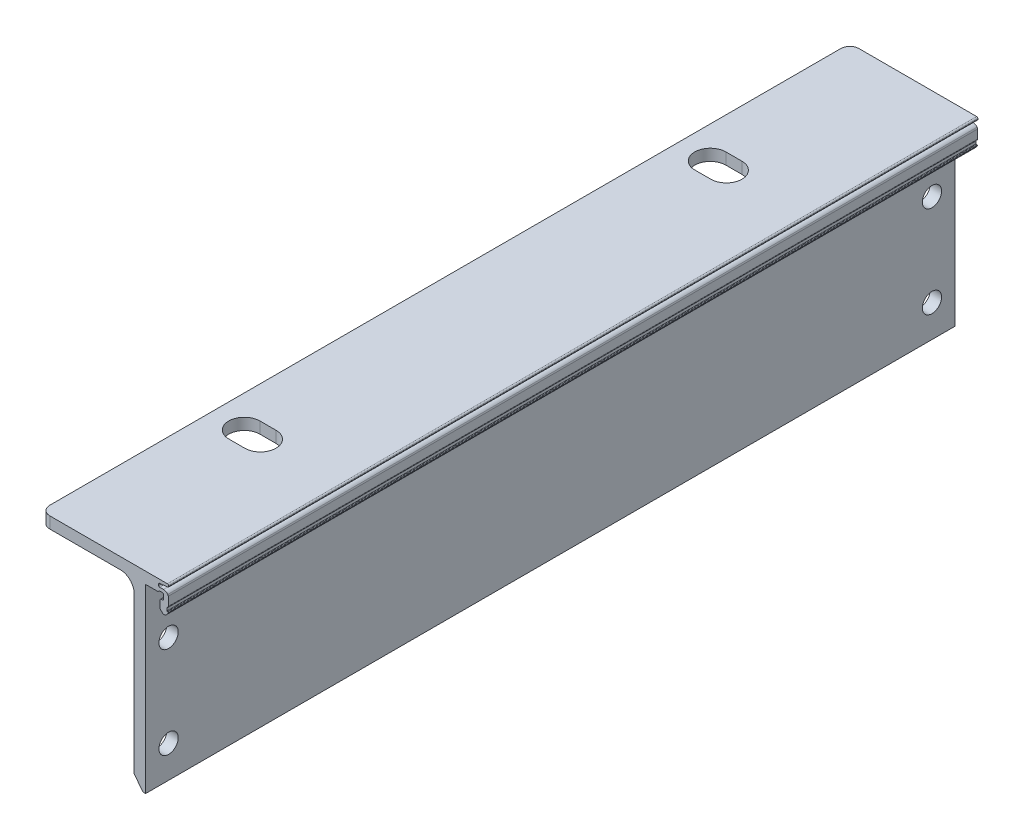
ISO-10303-21;
HEADER;
FILE_DESCRIPTION(('STEP AP214'),'2;1');
FILE_NAME('part.step','',(''),(''),'','','');
FILE_SCHEMA(('AUTOMOTIVE_DESIGN { 1 0 10303 214 1 1 1 1 }'));
ENDSEC;
DATA;
#1=APPLICATION_CONTEXT('core data for automotive mechanical design processes');
#2=APPLICATION_PROTOCOL_DEFINITION('international standard','automotive_design',2000,#1);
#3=PRODUCT_CONTEXT('',#1,'mechanical');
#4=PRODUCT('Part','Part','',(#3));
#5=PRODUCT_RELATED_PRODUCT_CATEGORY('part','',(#4));
#6=PRODUCT_DEFINITION_FORMATION('','',#4);
#7=PRODUCT_DEFINITION_CONTEXT('part definition',#1,'design');
#8=PRODUCT_DEFINITION('design','',#6,#7);
#9=PRODUCT_DEFINITION_SHAPE('','',#8);
#10=(LENGTH_UNIT() NAMED_UNIT(*) SI_UNIT(.MILLI.,.METRE.));
#11=(NAMED_UNIT(*) PLANE_ANGLE_UNIT() SI_UNIT($,.RADIAN.));
#12=(NAMED_UNIT(*) SI_UNIT($,.STERADIAN.) SOLID_ANGLE_UNIT());
#13=UNCERTAINTY_MEASURE_WITH_UNIT(LENGTH_MEASURE(1.E-05),#10,'distance_accuracy_value','');
#14=(GEOMETRIC_REPRESENTATION_CONTEXT(3) GLOBAL_UNCERTAINTY_ASSIGNED_CONTEXT((#13)) GLOBAL_UNIT_ASSIGNED_CONTEXT((#10,
#11,#12)) REPRESENTATION_CONTEXT('',''));
#15=CARTESIAN_POINT('',(0.,0.,0.));
#16=DIRECTION('',(0.,0.,1.));
#17=DIRECTION('',(1.,0.,0.));
#18=AXIS2_PLACEMENT_3D('',#15,#16,#17);
#19=CARTESIAN_POINT('',(2329.98403514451,-3290.10376988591,88.225));
#20=DIRECTION('',(0.,-1.,0.));
#21=DIRECTION('',(1.,0.,0.));
#22=AXIS2_PLACEMENT_3D('',#19,#20,#21);
#23=PLANE('',#22);
#24=DIRECTION('',(-1.,0.,0.));
#25=VECTOR('',#24,1.);
#26=CARTESIAN_POINT('',(2340.4840351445,-3290.10376988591,47.4000000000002));
#27=LINE('',#26,#25);
#28=CARTESIAN_POINT('',(2340.4840351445,-3290.10376988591,47.4000000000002));
#29=VERTEX_POINT('',#28);
#30=CARTESIAN_POINT('',(2336.9840351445,-3290.10376988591,47.4000000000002));
#31=VERTEX_POINT('',#30);
#32=EDGE_CURVE('E377',#29,#31,#27,.T.);
#33=ORIENTED_EDGE('',*,*,#32,.F.);
#34=CARTESIAN_POINT('',(2340.4840351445,-3290.10376988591,50.8));
#35=DIRECTION('',(0.,1.,0.));
#36=DIRECTION('',(1.,0.,0.));
#37=AXIS2_PLACEMENT_3D('',#34,#35,#36);
#38=CIRCLE('',#37,3.39999999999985);
#39=CARTESIAN_POINT('',(2340.4840351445,-3290.10376988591,54.1999999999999));
#40=VERTEX_POINT('',#39);
#41=EDGE_CURVE('E382',#40,#29,#38,.T.);
#42=ORIENTED_EDGE('',*,*,#41,.F.);
#43=DIRECTION('',(1.,0.,0.));
#44=VECTOR('',#43,1.);
#45=CARTESIAN_POINT('',(2340.4840351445,-3290.10376988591,54.1999999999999));
#46=LINE('',#45,#44);
#47=CARTESIAN_POINT('',(2336.9840351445,-3290.10376988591,54.1999999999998));
#48=VERTEX_POINT('',#47);
#49=EDGE_CURVE('E386',#48,#40,#46,.T.);
#50=ORIENTED_EDGE('',*,*,#49,.F.);
#51=CARTESIAN_POINT('',(2336.9840351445,-3290.10376988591,50.8));
#52=DIRECTION('',(0.,1.,0.));
#53=DIRECTION('',(1.,0.,0.));
#54=AXIS2_PLACEMENT_3D('',#51,#52,#53);
#55=CIRCLE('',#54,3.39999999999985);
#56=EDGE_CURVE('E366',#31,#48,#55,.T.);
#57=ORIENTED_EDGE('',*,*,#56,.F.);
#58=EDGE_LOOP('',(#33,#42,#50,#57));
#59=FACE_BOUND('',#58,.T.);
#60=DIRECTION('',(1.,0.,0.));
#61=VECTOR('',#60,1.);
#62=CARTESIAN_POINT('',(2340.4840351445,-3290.10376988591,-47.4000000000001));
#63=LINE('',#62,#61);
#64=CARTESIAN_POINT('',(2336.9840351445,-3290.10376988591,-47.4000000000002));
#65=VERTEX_POINT('',#64);
#66=CARTESIAN_POINT('',(2340.4840351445,-3290.10376988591,-47.4000000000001));
#67=VERTEX_POINT('',#66);
#68=EDGE_CURVE('E397',#65,#67,#63,.T.);
#69=ORIENTED_EDGE('',*,*,#68,.F.);
#70=CARTESIAN_POINT('',(2336.9840351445,-3290.10376988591,-50.8));
#71=DIRECTION('',(0.,1.,0.));
#72=DIRECTION('',(-1.,0.,0.));
#73=AXIS2_PLACEMENT_3D('',#70,#71,#72);
#74=CIRCLE('',#73,3.39999999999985);
#75=CARTESIAN_POINT('',(2336.9840351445,-3290.10376988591,-54.1999999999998));
#76=VERTEX_POINT('',#75);
#77=EDGE_CURVE('E393',#76,#65,#74,.T.);
#78=ORIENTED_EDGE('',*,*,#77,.F.);
#79=DIRECTION('',(-1.,0.,0.));
#80=VECTOR('',#79,1.);
#81=CARTESIAN_POINT('',(2340.4840351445,-3290.10376988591,-54.1999999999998));
#82=LINE('',#81,#80);
#83=CARTESIAN_POINT('',(2340.4840351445,-3290.10376988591,-54.1999999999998));
#84=VERTEX_POINT('',#83);
#85=EDGE_CURVE('E403',#84,#76,#82,.T.);
#86=ORIENTED_EDGE('',*,*,#85,.F.);
#87=CARTESIAN_POINT('',(2340.4840351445,-3290.10376988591,-50.8));
#88=DIRECTION('',(0.,1.,0.));
#89=DIRECTION('',(-1.,0.,0.));
#90=AXIS2_PLACEMENT_3D('',#87,#88,#89);
#91=CIRCLE('',#90,3.39999999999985);
#92=EDGE_CURVE('E400',#67,#84,#91,.T.);
#93=ORIENTED_EDGE('',*,*,#92,.F.);
#94=EDGE_LOOP('',(#69,#78,#86,#93));
#95=FACE_BOUND('',#94,.T.);
#96=DIRECTION('',(-1.,0.,0.));
#97=VECTOR('',#96,1.);
#98=CARTESIAN_POINT('',(2329.98403514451,-3290.10376988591,-88.225));
#99=LINE('',#98,#97);
#100=CARTESIAN_POINT('',(2357.62403514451,-3290.10376988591,-88.225));
#101=VERTEX_POINT('',#100);
#102=CARTESIAN_POINT('',(2331.98403514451,-3290.10376988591,-88.225));
#103=VERTEX_POINT('',#102);
#104=EDGE_CURVE('E409',#101,#103,#99,.T.);
#105=ORIENTED_EDGE('',*,*,#104,.T.);
#106=CARTESIAN_POINT('',(2331.98403514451,-3290.10376988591,-86.225));
#107=DIRECTION('',(0.,-1.,0.));
#108=DIRECTION('',(1.,0.,0.));
#109=AXIS2_PLACEMENT_3D('',#106,#107,#108);
#110=CIRCLE('',#109,2.);
#111=CARTESIAN_POINT('',(2329.98403514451,-3290.10376988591,-86.225));
#112=VERTEX_POINT('',#111);
#113=EDGE_CURVE('E43',#103,#112,#110,.F.);
#114=ORIENTED_EDGE('',*,*,#113,.T.);
#115=DIRECTION('',(0.,0.,-1.));
#116=VECTOR('',#115,1.);
#117=CARTESIAN_POINT('',(2329.98403514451,-3290.10376988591,88.225));
#118=LINE('',#117,#116);
#119=CARTESIAN_POINT('',(2329.98403514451,-3290.10376988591,86.225));
#120=VERTEX_POINT('',#119);
#121=EDGE_CURVE('E687',#120,#112,#118,.T.);
#122=ORIENTED_EDGE('',*,*,#121,.F.);
#123=CARTESIAN_POINT('',(2331.98403514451,-3290.10376988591,86.225));
#124=DIRECTION('',(0.,-1.,0.));
#125=DIRECTION('',(1.,0.,0.));
#126=AXIS2_PLACEMENT_3D('',#123,#124,#125);
#127=CIRCLE('',#126,2.);
#128=CARTESIAN_POINT('',(2331.98403514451,-3290.10376988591,88.225));
#129=VERTEX_POINT('',#128);
#130=EDGE_CURVE('E50',#120,#129,#127,.F.);
#131=ORIENTED_EDGE('',*,*,#130,.T.);
#132=DIRECTION('',(-1.,0.,0.));
#133=VECTOR('',#132,1.);
#134=CARTESIAN_POINT('',(2355.38403514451,-3290.10376988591,88.225));
#135=LINE('',#134,#133);
#136=CARTESIAN_POINT('',(2357.62403514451,-3290.10376988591,88.225));
#137=VERTEX_POINT('',#136);
#138=EDGE_CURVE('E416',#137,#129,#135,.T.);
#139=ORIENTED_EDGE('',*,*,#138,.F.);
#140=DIRECTION('',(0.,0.,-1.));
#141=VECTOR('',#140,1.);
#142=CARTESIAN_POINT('',(2357.62403514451,-3290.10376988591,88.225));
#143=LINE('',#142,#141);
#144=EDGE_CURVE('E495',#137,#101,#143,.T.);
#145=ORIENTED_EDGE('',*,*,#144,.T.);
#146=EDGE_LOOP('',(#105,#114,#122,#131,#139,#145));
#147=FACE_BOUND('',#146,.T.);
#148=ADVANCED_FACE('F35',(#59,#95,#147),#23,.F.);
#149=CARTESIAN_POINT('',(2329.98403514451,-3290.10376988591,88.225));
#150=DIRECTION('',(1.,0.,0.));
#151=DIRECTION('',(0.,0.,-1.));
#152=AXIS2_PLACEMENT_3D('',#149,#150,#151);
#153=PLANE('',#152);
#154=ORIENTED_EDGE('',*,*,#121,.T.);
#155=DIRECTION('',(0.,-1.,0.));
#156=VECTOR('',#155,1.);
#157=CARTESIAN_POINT('',(2329.98403514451,-3292.60376988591,-86.225));
#158=LINE('',#157,#156);
#159=CARTESIAN_POINT('',(2329.98403514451,-3292.60376988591,-86.225));
#160=VERTEX_POINT('',#159);
#161=EDGE_CURVE('E740',#112,#160,#158,.T.);
#162=ORIENTED_EDGE('',*,*,#161,.T.);
#163=DIRECTION('',(0.,0.,-1.));
#164=VECTOR('',#163,1.);
#165=CARTESIAN_POINT('',(2329.98403514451,-3292.60376988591,88.225));
#166=LINE('',#165,#164);
#167=CARTESIAN_POINT('',(2329.98403514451,-3292.60376988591,86.225));
#168=VERTEX_POINT('',#167);
#169=EDGE_CURVE('E684',#168,#160,#166,.T.);
#170=ORIENTED_EDGE('',*,*,#169,.F.);
#171=DIRECTION('',(0.,-1.,0.));
#172=VECTOR('',#171,1.);
#173=CARTESIAN_POINT('',(2329.98403514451,-3290.10376988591,86.225));
#174=LINE('',#173,#172);
#175=EDGE_CURVE('E722',#168,#120,#174,.F.);
#176=ORIENTED_EDGE('',*,*,#175,.T.);
#177=EDGE_LOOP('',(#154,#162,#170,#176));
#178=FACE_BOUND('',#177,.T.);
#179=ADVANCED_FACE('F752',(#178),#153,.F.);
#180=CARTESIAN_POINT('',(2329.98403514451,-3292.60376988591,88.225));
#181=DIRECTION('',(0.,1.,0.));
#182=DIRECTION('',(0.,0.,1.));
#183=AXIS2_PLACEMENT_3D('',#180,#181,#182);
#184=PLANE('',#183);
#185=DIRECTION('',(1.,0.,0.));
#186=VECTOR('',#185,1.);
#187=CARTESIAN_POINT('',(2329.98403514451,-3292.60376988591,54.1999999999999));
#188=LINE('',#187,#186);
#189=CARTESIAN_POINT('',(2336.9840351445,-3292.60376988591,54.1999999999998));
#190=VERTEX_POINT('',#189);
#191=CARTESIAN_POINT('',(2340.4840351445,-3292.60376988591,54.1999999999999));
#192=VERTEX_POINT('',#191);
#193=EDGE_CURVE('E716',#190,#192,#188,.T.);
#194=ORIENTED_EDGE('',*,*,#193,.T.);
#195=CARTESIAN_POINT('',(2340.4840351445,-3292.60376988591,50.8));
#196=DIRECTION('',(0.,1.,0.));
#197=DIRECTION('',(0.,0.,1.));
#198=AXIS2_PLACEMENT_3D('',#195,#196,#197);
#199=CIRCLE('',#198,3.39999999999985);
#200=CARTESIAN_POINT('',(2340.4840351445,-3292.60376988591,47.4000000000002));
#201=VERTEX_POINT('',#200);
#202=EDGE_CURVE('E719',#192,#201,#199,.T.);
#203=ORIENTED_EDGE('',*,*,#202,.T.);
#204=DIRECTION('',(-1.,0.,0.));
#205=VECTOR('',#204,1.);
#206=CARTESIAN_POINT('',(2329.98403514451,-3292.60376988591,47.4000000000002));
#207=LINE('',#206,#205);
#208=CARTESIAN_POINT('',(2336.9840351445,-3292.60376988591,47.4000000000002));
#209=VERTEX_POINT('',#208);
#210=EDGE_CURVE('E713',#201,#209,#207,.T.);
#211=ORIENTED_EDGE('',*,*,#210,.T.);
#212=CARTESIAN_POINT('',(2336.9840351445,-3292.60376988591,50.8));
#213=DIRECTION('',(0.,1.,0.));
#214=DIRECTION('',(0.,0.,1.));
#215=AXIS2_PLACEMENT_3D('',#212,#213,#214);
#216=CIRCLE('',#215,3.39999999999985);
#217=EDGE_CURVE('E369',#209,#190,#216,.T.);
#218=ORIENTED_EDGE('',*,*,#217,.T.);
#219=EDGE_LOOP('',(#194,#203,#211,#218));
#220=FACE_BOUND('',#219,.T.);
#221=DIRECTION('',(-1.,0.,0.));
#222=VECTOR('',#221,1.);
#223=CARTESIAN_POINT('',(2329.98403514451,-3292.60376988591,-54.1999999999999));
#224=LINE('',#223,#222);
#225=CARTESIAN_POINT('',(2340.4840351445,-3292.60376988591,-54.1999999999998));
#226=VERTEX_POINT('',#225);
#227=CARTESIAN_POINT('',(2336.9840351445,-3292.60376988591,-54.1999999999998));
#228=VERTEX_POINT('',#227);
#229=EDGE_CURVE('E707',#226,#228,#224,.T.);
#230=ORIENTED_EDGE('',*,*,#229,.T.);
#231=CARTESIAN_POINT('',(2336.9840351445,-3292.60376988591,-50.8));
#232=DIRECTION('',(0.,1.,0.));
#233=DIRECTION('',(0.,0.,1.));
#234=AXIS2_PLACEMENT_3D('',#231,#232,#233);
#235=CIRCLE('',#234,3.39999999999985);
#236=CARTESIAN_POINT('',(2336.9840351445,-3292.60376988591,-47.4000000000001));
#237=VERTEX_POINT('',#236);
#238=EDGE_CURVE('E710',#228,#237,#235,.T.);
#239=ORIENTED_EDGE('',*,*,#238,.T.);
#240=DIRECTION('',(1.,0.,0.));
#241=VECTOR('',#240,1.);
#242=CARTESIAN_POINT('',(2329.98403514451,-3292.60376988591,-47.4000000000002));
#243=LINE('',#242,#241);
#244=CARTESIAN_POINT('',(2340.4840351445,-3292.60376988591,-47.4000000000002));
#245=VERTEX_POINT('',#244);
#246=EDGE_CURVE('E701',#237,#245,#243,.T.);
#247=ORIENTED_EDGE('',*,*,#246,.T.);
#248=CARTESIAN_POINT('',(2340.4840351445,-3292.60376988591,-50.8));
#249=DIRECTION('',(0.,1.,0.));
#250=DIRECTION('',(0.,0.,1.));
#251=AXIS2_PLACEMENT_3D('',#248,#249,#250);
#252=CIRCLE('',#251,3.39999999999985);
#253=EDGE_CURVE('E704',#245,#226,#252,.T.);
#254=ORIENTED_EDGE('',*,*,#253,.T.);
#255=EDGE_LOOP('',(#230,#239,#247,#254));
#256=FACE_BOUND('',#255,.T.);
#257=ORIENTED_EDGE('',*,*,#169,.T.);
#258=CARTESIAN_POINT('',(2331.98403514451,-3292.60376988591,-86.225));
#259=DIRECTION('',(0.,1.,0.));
#260=DIRECTION('',(0.,0.,1.));
#261=AXIS2_PLACEMENT_3D('',#258,#259,#260);
#262=CIRCLE('',#261,2.);
#263=CARTESIAN_POINT('',(2331.98403514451,-3292.60376988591,-88.225));
#264=VERTEX_POINT('',#263);
#265=EDGE_CURVE('E745',#160,#264,#262,.F.);
#266=ORIENTED_EDGE('',*,*,#265,.T.);
#267=DIRECTION('',(1.,0.,0.));
#268=VECTOR('',#267,1.);
#269=CARTESIAN_POINT('',(2329.98403514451,-3292.60376988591,-88.225));
#270=LINE('',#269,#268);
#271=CARTESIAN_POINT('',(2347.3840351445,-3292.60376988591,-88.225));
#272=VERTEX_POINT('',#271);
#273=EDGE_CURVE('E497',#264,#272,#270,.T.);
#274=ORIENTED_EDGE('',*,*,#273,.T.);
#275=DIRECTION('',(0.,0.,-1.));
#276=VECTOR('',#275,1.);
#277=CARTESIAN_POINT('',(2347.3840351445,-3292.60376988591,88.225));
#278=LINE('',#277,#276);
#279=CARTESIAN_POINT('',(2347.3840351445,-3292.60376988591,88.225));
#280=VERTEX_POINT('',#279);
#281=EDGE_CURVE('E693',#272,#280,#278,.F.);
#282=ORIENTED_EDGE('',*,*,#281,.T.);
#283=DIRECTION('',(1.,0.,0.));
#284=VECTOR('',#283,1.);
#285=CARTESIAN_POINT('',(2329.98403514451,-3292.60376988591,88.225));
#286=LINE('',#285,#284);
#287=CARTESIAN_POINT('',(2331.98403514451,-3292.60376988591,88.225));
#288=VERTEX_POINT('',#287);
#289=EDGE_CURVE('E418',#288,#280,#286,.T.);
#290=ORIENTED_EDGE('',*,*,#289,.F.);
#291=CARTESIAN_POINT('',(2331.98403514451,-3292.60376988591,86.225));
#292=DIRECTION('',(0.,1.,0.));
#293=DIRECTION('',(0.,0.,1.));
#294=AXIS2_PLACEMENT_3D('',#291,#292,#293);
#295=CIRCLE('',#294,2.);
#296=EDGE_CURVE('E743',#288,#168,#295,.F.);
#297=ORIENTED_EDGE('',*,*,#296,.T.);
#298=EDGE_LOOP('',(#257,#266,#274,#282,#290,#297));
#299=FACE_BOUND('',#298,.T.);
#300=ADVANCED_FACE('F757',(#220,#256,#299),#184,.F.);
#301=CARTESIAN_POINT('',(2350.3840351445,-3292.60376988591,88.225));
#302=DIRECTION('',(1.,0.,0.));
#303=DIRECTION('',(0.,0.,-1.));
#304=AXIS2_PLACEMENT_3D('',#301,#302,#303);
#305=PLANE('',#304);
#306=CARTESIAN_POINT('',(2350.38403514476,-3325.10376988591,83.225));
#307=DIRECTION('',(-1.,0.,0.));
#308=DIRECTION('',(0.,1.,0.));
#309=AXIS2_PLACEMENT_3D('',#306,#307,#308);
#310=CIRCLE('',#309,2.09999999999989);
#311=CARTESIAN_POINT('',(2350.38403514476,-3323.00376988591,83.225));
#312=VERTEX_POINT('',#311);
#313=EDGE_CURVE('E738',#312,#312,#310,.T.);
#314=ORIENTED_EDGE('',*,*,#313,.F.);
#315=EDGE_LOOP('',(#314));
#316=FACE_BOUND('',#315,.T.);
#317=CARTESIAN_POINT('',(2350.38403514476,-3325.10376988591,-83.225));
#318=DIRECTION('',(-1.,0.,0.));
#319=DIRECTION('',(0.,-1.,0.));
#320=AXIS2_PLACEMENT_3D('',#317,#318,#319);
#321=CIRCLE('',#320,2.09999999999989);
#322=CARTESIAN_POINT('',(2350.38403514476,-3327.20376988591,-83.225));
#323=VERTEX_POINT('',#322);
#324=EDGE_CURVE('E734',#323,#323,#321,.T.);
#325=ORIENTED_EDGE('',*,*,#324,.F.);
#326=EDGE_LOOP('',(#325));
#327=FACE_BOUND('',#326,.T.);
#328=CARTESIAN_POINT('',(2350.38403514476,-3305.10376988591,83.225));
#329=DIRECTION('',(-1.,0.,0.));
#330=DIRECTION('',(0.,1.,0.));
#331=AXIS2_PLACEMENT_3D('',#328,#329,#330);
#332=CIRCLE('',#331,2.09999999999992);
#333=CARTESIAN_POINT('',(2350.38403514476,-3303.00376988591,83.225));
#334=VERTEX_POINT('',#333);
#335=EDGE_CURVE('E730',#334,#334,#332,.T.);
#336=ORIENTED_EDGE('',*,*,#335,.F.);
#337=EDGE_LOOP('',(#336));
#338=FACE_BOUND('',#337,.T.);
#339=CARTESIAN_POINT('',(2350.38403514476,-3305.10376988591,-83.225));
#340=DIRECTION('',(-1.,0.,0.));
#341=DIRECTION('',(0.,-1.,0.));
#342=AXIS2_PLACEMENT_3D('',#339,#340,#341);
#343=CIRCLE('',#342,2.09999999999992);
#344=CARTESIAN_POINT('',(2350.38403514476,-3307.20376988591,-83.225));
#345=VERTEX_POINT('',#344);
#346=EDGE_CURVE('E726',#345,#345,#343,.T.);
#347=ORIENTED_EDGE('',*,*,#346,.F.);
#348=EDGE_LOOP('',(#347));
#349=FACE_BOUND('',#348,.T.);
#350=DIRECTION('',(0.,-1.,0.));
#351=VECTOR('',#350,1.);
#352=CARTESIAN_POINT('',(2350.3840351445,-3292.60376988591,88.225));
#353=LINE('',#352,#351);
#354=CARTESIAN_POINT('',(2350.3840351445,-3295.60376988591,88.225));
#355=VERTEX_POINT('',#354);
#356=CARTESIAN_POINT('',(2350.3840351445,-3329.60376988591,88.225));
#357=VERTEX_POINT('',#356);
#358=EDGE_CURVE('E421',#355,#357,#353,.T.);
#359=ORIENTED_EDGE('',*,*,#358,.F.);
#360=DIRECTION('',(0.,0.,-1.));
#361=VECTOR('',#360,1.);
#362=CARTESIAN_POINT('',(2350.3840351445,-3295.60376988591,-88.225));
#363=LINE('',#362,#361);
#364=CARTESIAN_POINT('',(2350.3840351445,-3295.60376988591,-88.225));
#365=VERTEX_POINT('',#364);
#366=EDGE_CURVE('E690',#355,#365,#363,.T.);
#367=ORIENTED_EDGE('',*,*,#366,.T.);
#368=DIRECTION('',(0.,-1.,0.));
#369=VECTOR('',#368,1.);
#370=CARTESIAN_POINT('',(2350.3840351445,-3292.60376988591,-88.225));
#371=LINE('',#370,#369);
#372=CARTESIAN_POINT('',(2350.3840351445,-3329.60376988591,-88.225));
#373=VERTEX_POINT('',#372);
#374=EDGE_CURVE('E499',#365,#373,#371,.T.);
#375=ORIENTED_EDGE('',*,*,#374,.T.);
#376=DIRECTION('',(0.,0.,-1.));
#377=VECTOR('',#376,1.);
#378=CARTESIAN_POINT('',(2350.3840351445,-3329.60376988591,88.225));
#379=LINE('',#378,#377);
#380=EDGE_CURVE('E681',#357,#373,#379,.T.);
#381=ORIENTED_EDGE('',*,*,#380,.F.);
#382=EDGE_LOOP('',(#359,#367,#375,#381));
#383=FACE_BOUND('',#382,.T.);
#384=ADVANCED_FACE('F943',(#316,#327,#338,#349,#383),#305,.F.);
#385=CARTESIAN_POINT('',(2350.3840351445,-3329.60376988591,88.225));
#386=DIRECTION('',(0.796162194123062,0.605083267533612,0.));
#387=DIRECTION('',(-0.605083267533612,0.796162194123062,0.));
#388=AXIS2_PLACEMENT_3D('',#385,#386,#387);
#389=PLANE('',#388);
#390=DIRECTION('',(0.605083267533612,-0.796162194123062,0.));
#391=VECTOR('',#390,1.);
#392=CARTESIAN_POINT('',(2350.3840351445,-3329.60376988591,-88.225));
#393=LINE('',#392,#391);
#394=CARTESIAN_POINT('',(2352.28403514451,-3332.10376988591,-88.225));
#395=VERTEX_POINT('',#394);
#396=EDGE_CURVE('E501',#373,#395,#393,.T.);
#397=ORIENTED_EDGE('',*,*,#396,.T.);
#398=DIRECTION('',(0.,0.,-1.));
#399=VECTOR('',#398,1.);
#400=CARTESIAN_POINT('',(2352.28403514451,-3332.10376988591,88.225));
#401=LINE('',#400,#399);
#402=CARTESIAN_POINT('',(2352.28403514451,-3332.10376988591,88.225));
#403=VERTEX_POINT('',#402);
#404=EDGE_CURVE('E678',#403,#395,#401,.T.);
#405=ORIENTED_EDGE('',*,*,#404,.F.);
#406=DIRECTION('',(0.605083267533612,-0.796162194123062,0.));
#407=VECTOR('',#406,1.);
#408=CARTESIAN_POINT('',(2350.3840351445,-3329.60376988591,88.225));
#409=LINE('',#408,#407);
#410=EDGE_CURVE('E423',#357,#403,#409,.T.);
#411=ORIENTED_EDGE('',*,*,#410,.F.);
#412=ORIENTED_EDGE('',*,*,#380,.T.);
#413=EDGE_LOOP('',(#397,#405,#411,#412));
#414=FACE_BOUND('',#413,.T.);
#415=ADVANCED_FACE('F939',(#414),#389,.F.);
#416=CARTESIAN_POINT('',(2352.88403514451,-3332.10376988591,88.225));
#417=DIRECTION('',(0.,1.,0.));
#418=DIRECTION('',(0.,0.,1.));
#419=AXIS2_PLACEMENT_3D('',#416,#417,#418);
#420=PLANE('',#419);
#421=DIRECTION('',(1.,0.,0.));
#422=VECTOR('',#421,1.);
#423=CARTESIAN_POINT('',(2352.88403514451,-3332.10376988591,-88.225));
#424=LINE('',#423,#422);
#425=CARTESIAN_POINT('',(2352.88403514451,-3332.10376988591,-88.225));
#426=VERTEX_POINT('',#425);
#427=EDGE_CURVE('E503',#395,#426,#424,.T.);
#428=ORIENTED_EDGE('',*,*,#427,.T.);
#429=DIRECTION('',(0.,0.,-1.));
#430=VECTOR('',#429,1.);
#431=CARTESIAN_POINT('',(2352.88403514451,-3332.10376988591,88.225));
#432=LINE('',#431,#430);
#433=CARTESIAN_POINT('',(2352.88403514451,-3332.10376988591,88.225));
#434=VERTEX_POINT('',#433);
#435=EDGE_CURVE('E675',#434,#426,#432,.T.);
#436=ORIENTED_EDGE('',*,*,#435,.F.);
#437=DIRECTION('',(1.,0.,0.));
#438=VECTOR('',#437,1.);
#439=CARTESIAN_POINT('',(2352.88403514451,-3332.10376988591,88.225));
#440=LINE('',#439,#438);
#441=EDGE_CURVE('E425',#403,#434,#440,.T.);
#442=ORIENTED_EDGE('',*,*,#441,.F.);
#443=ORIENTED_EDGE('',*,*,#404,.T.);
#444=EDGE_LOOP('',(#428,#436,#442,#443));
#445=FACE_BOUND('',#444,.T.);
#446=ADVANCED_FACE('F935',(#445),#420,.F.);
#447=CARTESIAN_POINT('',(2352.88403514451,-3292.60376988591,88.225));
#448=DIRECTION('',(-1.,0.,0.));
#449=DIRECTION('',(0.,0.,1.));
#450=AXIS2_PLACEMENT_3D('',#447,#448,#449);
#451=PLANE('',#450);
#452=CARTESIAN_POINT('',(2352.88403514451,-3325.10376988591,83.225));
#453=DIRECTION('',(-1.,0.,0.));
#454=DIRECTION('',(0.,0.,1.));
#455=AXIS2_PLACEMENT_3D('',#452,#453,#454);
#456=CIRCLE('',#455,2.09999999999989);
#457=CARTESIAN_POINT('',(2352.88403514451,-3325.10376988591,85.3249999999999));
#458=VERTEX_POINT('',#457);
#459=EDGE_CURVE('E735',#458,#458,#456,.T.);
#460=ORIENTED_EDGE('',*,*,#459,.T.);
#461=EDGE_LOOP('',(#460));
#462=FACE_BOUND('',#461,.T.);
#463=CARTESIAN_POINT('',(2352.88403514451,-3325.10376988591,-83.225));
#464=DIRECTION('',(-1.,0.,0.));
#465=DIRECTION('',(0.,0.,1.));
#466=AXIS2_PLACEMENT_3D('',#463,#464,#465);
#467=CIRCLE('',#466,2.09999999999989);
#468=CARTESIAN_POINT('',(2352.88403514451,-3325.10376988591,-81.1250000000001));
#469=VERTEX_POINT('',#468);
#470=EDGE_CURVE('E731',#469,#469,#467,.T.);
#471=ORIENTED_EDGE('',*,*,#470,.T.);
#472=EDGE_LOOP('',(#471));
#473=FACE_BOUND('',#472,.T.);
#474=CARTESIAN_POINT('',(2352.88403514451,-3305.10376988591,83.225));
#475=DIRECTION('',(-1.,0.,0.));
#476=DIRECTION('',(0.,0.,1.));
#477=AXIS2_PLACEMENT_3D('',#474,#475,#476);
#478=CIRCLE('',#477,2.09999999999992);
#479=CARTESIAN_POINT('',(2352.88403514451,-3305.10376988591,85.3249999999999));
#480=VERTEX_POINT('',#479);
#481=EDGE_CURVE('E727',#480,#480,#478,.T.);
#482=ORIENTED_EDGE('',*,*,#481,.T.);
#483=EDGE_LOOP('',(#482));
#484=FACE_BOUND('',#483,.T.);
#485=CARTESIAN_POINT('',(2352.88403514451,-3305.10376988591,-83.225));
#486=DIRECTION('',(-1.,0.,0.));
#487=DIRECTION('',(0.,0.,1.));
#488=AXIS2_PLACEMENT_3D('',#485,#486,#487);
#489=CIRCLE('',#488,2.09999999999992);
#490=CARTESIAN_POINT('',(2352.88403514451,-3305.10376988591,-81.1250000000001));
#491=VERTEX_POINT('',#490);
#492=EDGE_CURVE('E723',#491,#491,#489,.T.);
#493=ORIENTED_EDGE('',*,*,#492,.T.);
#494=EDGE_LOOP('',(#493));
#495=FACE_BOUND('',#494,.T.);
#496=DIRECTION('',(0.,1.,0.));
#497=VECTOR('',#496,1.);
#498=CARTESIAN_POINT('',(2352.88403514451,-3292.60376988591,-88.225));
#499=LINE('',#498,#497);
#500=CARTESIAN_POINT('',(2352.88403514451,-3292.60376988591,-88.225));
#501=VERTEX_POINT('',#500);
#502=EDGE_CURVE('E505',#426,#501,#499,.T.);
#503=ORIENTED_EDGE('',*,*,#502,.T.);
#504=DIRECTION('',(0.,0.,-1.));
#505=VECTOR('',#504,1.);
#506=CARTESIAN_POINT('',(2352.88403514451,-3292.60376988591,88.225));
#507=LINE('',#506,#505);
#508=CARTESIAN_POINT('',(2352.88403514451,-3292.60376988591,88.225));
#509=VERTEX_POINT('',#508);
#510=EDGE_CURVE('E672',#509,#501,#507,.T.);
#511=ORIENTED_EDGE('',*,*,#510,.F.);
#512=DIRECTION('',(0.,1.,0.));
#513=VECTOR('',#512,1.);
#514=CARTESIAN_POINT('',(2352.88403514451,-3292.60376988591,88.225));
#515=LINE('',#514,#513);
#516=EDGE_CURVE('E427',#434,#509,#515,.T.);
#517=ORIENTED_EDGE('',*,*,#516,.F.);
#518=ORIENTED_EDGE('',*,*,#435,.T.);
#519=EDGE_LOOP('',(#503,#511,#517,#518));
#520=FACE_BOUND('',#519,.T.);
#521=ADVANCED_FACE('F931',(#462,#473,#484,#495,#520),#451,.F.);
#522=CARTESIAN_POINT('',(2355.38403514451,-3292.60376988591,88.225));
#523=DIRECTION('',(0.,1.,0.));
#524=DIRECTION('',(0.,0.,1.));
#525=AXIS2_PLACEMENT_3D('',#522,#523,#524);
#526=PLANE('',#525);
#527=DIRECTION('',(1.,0.,0.));
#528=VECTOR('',#527,1.);
#529=CARTESIAN_POINT('',(2355.38403514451,-3292.60376988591,-88.225));
#530=LINE('',#529,#528);
#531=CARTESIAN_POINT('',(2355.46834905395,-3292.60376988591,-88.225));
#532=VERTEX_POINT('',#531);
#533=EDGE_CURVE('E508',#501,#532,#530,.T.);
#534=ORIENTED_EDGE('',*,*,#533,.T.);
#535=DIRECTION('',(0.,0.,-1.));
#536=VECTOR('',#535,1.);
#537=CARTESIAN_POINT('',(2355.46834905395,-3292.60376988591,88.225));
#538=LINE('',#537,#536);
#539=CARTESIAN_POINT('',(2355.46834905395,-3292.60376988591,88.225));
#540=VERTEX_POINT('',#539);
#541=EDGE_CURVE('E669',#540,#532,#538,.T.);
#542=ORIENTED_EDGE('',*,*,#541,.F.);
#543=DIRECTION('',(1.,-3.55271367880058E-13,0.));
#544=VECTOR('',#543,1.);
#545=CARTESIAN_POINT('',(2352.88403514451,-3292.60376988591,88.225));
#546=LINE('',#545,#544);
#547=EDGE_CURVE('E429',#509,#540,#546,.T.);
#548=ORIENTED_EDGE('',*,*,#547,.F.);
#549=ORIENTED_EDGE('',*,*,#510,.T.);
#550=EDGE_LOOP('',(#534,#542,#548,#549));
#551=FACE_BOUND('',#550,.T.);
#552=ADVANCED_FACE('F927',(#551),#526,.F.);
#553=CARTESIAN_POINT('',(2355.46834905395,-3292.30376988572,88.225));
#554=DIRECTION('',(0.,0.,-1.));
#555=DIRECTION('',(-1.,0.,0.));
#556=AXIS2_PLACEMENT_3D('',#553,#554,#555);
#557=CYLINDRICAL_SURFACE('',#556,0.300000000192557);
#558=CARTESIAN_POINT('',(2355.46834905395,-3292.30376988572,-88.225));
#559=DIRECTION('',(0.,0.,1.));
#560=DIRECTION('',(-1.,0.,0.));
#561=AXIS2_PLACEMENT_3D('',#558,#559,#560);
#562=CIRCLE('',#561,0.300000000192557);
#563=CARTESIAN_POINT('',(2355.72815667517,-3292.45376988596,-88.225));
#564=VERTEX_POINT('',#563);
#565=EDGE_CURVE('E510',#532,#564,#562,.T.);
#566=ORIENTED_EDGE('',*,*,#565,.T.);
#567=DIRECTION('',(0.,0.,-1.));
#568=VECTOR('',#567,1.);
#569=CARTESIAN_POINT('',(2355.72815667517,-3292.45376988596,88.225));
#570=LINE('',#569,#568);
#571=CARTESIAN_POINT('',(2355.72815667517,-3292.45376988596,88.225));
#572=VERTEX_POINT('',#571);
#573=EDGE_CURVE('E666',#572,#564,#570,.T.);
#574=ORIENTED_EDGE('',*,*,#573,.F.);
#575=CARTESIAN_POINT('',(2355.46834905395,-3292.30376988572,88.225));
#576=DIRECTION('',(0.,0.,1.));
#577=DIRECTION('',(-1.,0.,0.));
#578=AXIS2_PLACEMENT_3D('',#575,#576,#577);
#579=CIRCLE('',#578,0.300000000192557);
#580=EDGE_CURVE('E431',#540,#572,#579,.T.);
#581=ORIENTED_EDGE('',*,*,#580,.F.);
#582=ORIENTED_EDGE('',*,*,#541,.T.);
#583=EDGE_LOOP('',(#566,#574,#581,#582));
#584=FACE_BOUND('',#583,.T.);
#585=ADVANCED_FACE('F923',(#584),#557,.T.);
#586=CARTESIAN_POINT('',(2355.9879642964,-3292.60376988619,88.225));
#587=DIRECTION('',(0.,0.,-1.));
#588=DIRECTION('',(-1.,0.,0.));
#589=AXIS2_PLACEMENT_3D('',#586,#587,#588);
#590=CYLINDRICAL_SURFACE('',#589,0.300000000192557);
#591=CARTESIAN_POINT('',(2355.9879642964,-3292.60376988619,-88.225));
#592=DIRECTION('',(0.,0.,-1.));
#593=DIRECTION('',(-1.,0.,0.));
#594=AXIS2_PLACEMENT_3D('',#591,#592,#593);
#595=CIRCLE('',#594,0.300000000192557);
#596=CARTESIAN_POINT('',(2355.9879642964,-3292.303769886,-88.225));
#597=VERTEX_POINT('',#596);
#598=EDGE_CURVE('E512',#564,#597,#595,.T.);
#599=ORIENTED_EDGE('',*,*,#598,.T.);
#600=DIRECTION('',(0.,0.,-1.));
#601=VECTOR('',#600,1.);
#602=CARTESIAN_POINT('',(2355.9879642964,-3292.303769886,88.225));
#603=LINE('',#602,#601);
#604=CARTESIAN_POINT('',(2355.9879642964,-3292.303769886,88.225));
#605=VERTEX_POINT('',#604);
#606=EDGE_CURVE('E663',#605,#597,#603,.T.);
#607=ORIENTED_EDGE('',*,*,#606,.F.);
#608=CARTESIAN_POINT('',(2355.9879642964,-3292.60376988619,88.225));
#609=DIRECTION('',(0.,0.,-1.));
#610=DIRECTION('',(-1.,0.,0.));
#611=AXIS2_PLACEMENT_3D('',#608,#609,#610);
#612=CIRCLE('',#611,0.300000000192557);
#613=EDGE_CURVE('E433',#572,#605,#612,.T.);
#614=ORIENTED_EDGE('',*,*,#613,.F.);
#615=ORIENTED_EDGE('',*,*,#573,.T.);
#616=EDGE_LOOP('',(#599,#607,#614,#615));
#617=FACE_BOUND('',#616,.T.);
#618=ADVANCED_FACE('F919',(#617),#590,.F.);
#619=CARTESIAN_POINT('',(2356.52403514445,-3292.303769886,88.225));
#620=DIRECTION('',(0.,1.,0.));
#621=DIRECTION('',(0.,0.,1.));
#622=AXIS2_PLACEMENT_3D('',#619,#620,#621);
#623=PLANE('',#622);
#624=DIRECTION('',(1.,0.,0.));
#625=VECTOR('',#624,1.);
#626=CARTESIAN_POINT('',(2356.52403514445,-3292.303769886,-88.225));
#627=LINE('',#626,#625);
#628=CARTESIAN_POINT('',(2356.52403514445,-3292.303769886,-88.225));
#629=VERTEX_POINT('',#628);
#630=EDGE_CURVE('E514',#597,#629,#627,.T.);
#631=ORIENTED_EDGE('',*,*,#630,.T.);
#632=DIRECTION('',(0.,0.,-1.));
#633=VECTOR('',#632,1.);
#634=CARTESIAN_POINT('',(2356.52403514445,-3292.303769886,88.225));
#635=LINE('',#634,#633);
#636=CARTESIAN_POINT('',(2356.52403514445,-3292.303769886,88.225));
#637=VERTEX_POINT('',#636);
#638=EDGE_CURVE('E660',#637,#629,#635,.T.);
#639=ORIENTED_EDGE('',*,*,#638,.F.);
#640=DIRECTION('',(1.,0.,0.));
#641=VECTOR('',#640,1.);
#642=CARTESIAN_POINT('',(2356.52403514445,-3292.303769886,88.225));
#643=LINE('',#642,#641);
#644=EDGE_CURVE('E435',#605,#637,#643,.T.);
#645=ORIENTED_EDGE('',*,*,#644,.F.);
#646=ORIENTED_EDGE('',*,*,#606,.T.);
#647=EDGE_LOOP('',(#631,#639,#645,#646));
#648=FACE_BOUND('',#647,.T.);
#649=ADVANCED_FACE('F915',(#648),#623,.F.);
#650=CARTESIAN_POINT('',(2356.52403514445,-3292.603769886,88.225));
#651=DIRECTION('',(0.,0.,-1.));
#652=DIRECTION('',(-1.,0.,0.));
#653=AXIS2_PLACEMENT_3D('',#650,#651,#652);
#654=CYLINDRICAL_SURFACE('',#653,0.300000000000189);
#655=CARTESIAN_POINT('',(2356.52403514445,-3292.603769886,-88.225));
#656=DIRECTION('',(0.,0.,-1.));
#657=DIRECTION('',(-1.,0.,0.));
#658=AXIS2_PLACEMENT_3D('',#655,#656,#657);
#659=CIRCLE('',#658,0.300000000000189);
#660=CARTESIAN_POINT('',(2356.82403514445,-3292.603769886,-88.225));
#661=VERTEX_POINT('',#660);
#662=EDGE_CURVE('E516',#629,#661,#659,.T.);
#663=ORIENTED_EDGE('',*,*,#662,.T.);
#664=DIRECTION('',(0.,0.,-1.));
#665=VECTOR('',#664,1.);
#666=CARTESIAN_POINT('',(2356.82403514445,-3292.603769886,88.225));
#667=LINE('',#666,#665);
#668=CARTESIAN_POINT('',(2356.82403514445,-3292.603769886,88.225));
#669=VERTEX_POINT('',#668);
#670=EDGE_CURVE('E657',#669,#661,#667,.T.);
#671=ORIENTED_EDGE('',*,*,#670,.F.);
#672=CARTESIAN_POINT('',(2356.52403514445,-3292.603769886,88.225));
#673=DIRECTION('',(0.,0.,-1.));
#674=DIRECTION('',(-1.,0.,0.));
#675=AXIS2_PLACEMENT_3D('',#672,#673,#674);
#676=CIRCLE('',#675,0.300000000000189);
#677=EDGE_CURVE('E437',#637,#669,#676,.T.);
#678=ORIENTED_EDGE('',*,*,#677,.F.);
#679=ORIENTED_EDGE('',*,*,#638,.T.);
#680=EDGE_LOOP('',(#663,#671,#678,#679));
#681=FACE_BOUND('',#680,.T.);
#682=ADVANCED_FACE('F911',(#681),#654,.F.);
#683=CARTESIAN_POINT('',(2356.82403514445,-3293.40376988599,88.225));
#684=DIRECTION('',(1.,0.,0.));
#685=DIRECTION('',(0.,0.,-1.));
#686=AXIS2_PLACEMENT_3D('',#683,#684,#685);
#687=PLANE('',#686);
#688=DIRECTION('',(0.,-1.,0.));
#689=VECTOR('',#688,1.);
#690=CARTESIAN_POINT('',(2356.82403514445,-3293.40376988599,-88.225));
#691=LINE('',#690,#689);
#692=CARTESIAN_POINT('',(2356.82403514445,-3293.40376988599,-88.225));
#693=VERTEX_POINT('',#692);
#694=EDGE_CURVE('E518',#661,#693,#691,.T.);
#695=ORIENTED_EDGE('',*,*,#694,.T.);
#696=DIRECTION('',(0.,0.,-1.));
#697=VECTOR('',#696,1.);
#698=CARTESIAN_POINT('',(2356.82403514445,-3293.40376988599,88.225));
#699=LINE('',#698,#697);
#700=CARTESIAN_POINT('',(2356.82403514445,-3293.40376988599,88.225));
#701=VERTEX_POINT('',#700);
#702=EDGE_CURVE('E654',#701,#693,#699,.T.);
#703=ORIENTED_EDGE('',*,*,#702,.F.);
#704=DIRECTION('',(0.,-1.,0.));
#705=VECTOR('',#704,1.);
#706=CARTESIAN_POINT('',(2356.82403514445,-3293.40376988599,88.225));
#707=LINE('',#706,#705);
#708=EDGE_CURVE('E439',#669,#701,#707,.T.);
#709=ORIENTED_EDGE('',*,*,#708,.F.);
#710=ORIENTED_EDGE('',*,*,#670,.T.);
#711=EDGE_LOOP('',(#695,#703,#709,#710));
#712=FACE_BOUND('',#711,.T.);
#713=ADVANCED_FACE('F907',(#712),#687,.F.);
#714=CARTESIAN_POINT('',(2356.52403514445,-3293.40376988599,88.225));
#715=DIRECTION('',(0.,0.,-1.));
#716=DIRECTION('',(-1.,0.,0.));
#717=AXIS2_PLACEMENT_3D('',#714,#715,#716);
#718=CYLINDRICAL_SURFACE('',#717,0.300000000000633);
#719=CARTESIAN_POINT('',(2356.52403514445,-3293.40376988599,-88.225));
#720=DIRECTION('',(0.,0.,-1.));
#721=DIRECTION('',(-1.,0.,0.));
#722=AXIS2_PLACEMENT_3D('',#719,#720,#721);
#723=CIRCLE('',#722,0.300000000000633);
#724=CARTESIAN_POINT('',(2356.52403514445,-3293.70376988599,-88.225));
#725=VERTEX_POINT('',#724);
#726=EDGE_CURVE('E520',#693,#725,#723,.T.);
#727=ORIENTED_EDGE('',*,*,#726,.T.);
#728=DIRECTION('',(0.,0.,-1.));
#729=VECTOR('',#728,1.);
#730=CARTESIAN_POINT('',(2356.52403514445,-3293.70376988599,88.225));
#731=LINE('',#730,#729);
#732=CARTESIAN_POINT('',(2356.52403514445,-3293.70376988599,88.225));
#733=VERTEX_POINT('',#732);
#734=EDGE_CURVE('E651',#733,#725,#731,.T.);
#735=ORIENTED_EDGE('',*,*,#734,.F.);
#736=CARTESIAN_POINT('',(2356.52403514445,-3293.40376988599,88.225));
#737=DIRECTION('',(0.,0.,-1.));
#738=DIRECTION('',(-1.,0.,0.));
#739=AXIS2_PLACEMENT_3D('',#736,#737,#738);
#740=CIRCLE('',#739,0.300000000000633);
#741=EDGE_CURVE('E441',#701,#733,#740,.T.);
#742=ORIENTED_EDGE('',*,*,#741,.F.);
#743=ORIENTED_EDGE('',*,*,#702,.T.);
#744=EDGE_LOOP('',(#727,#735,#742,#743));
#745=FACE_BOUND('',#744,.T.);
#746=ADVANCED_FACE('F903',(#745),#718,.F.);
#747=CARTESIAN_POINT('',(2356.32403514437,-3293.70376988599,88.225));
#748=DIRECTION('',(0.,-1.,0.));
#749=DIRECTION('',(0.,0.,-1.));
#750=AXIS2_PLACEMENT_3D('',#747,#748,#749);
#751=PLANE('',#750);
#752=DIRECTION('',(-1.,0.,0.));
#753=VECTOR('',#752,1.);
#754=CARTESIAN_POINT('',(2356.32403514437,-3293.70376988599,-88.225));
#755=LINE('',#754,#753);
#756=CARTESIAN_POINT('',(2356.32403514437,-3293.70376988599,-88.225));
#757=VERTEX_POINT('',#756);
#758=EDGE_CURVE('E522',#725,#757,#755,.T.);
#759=ORIENTED_EDGE('',*,*,#758,.T.);
#760=DIRECTION('',(0.,0.,-1.));
#761=VECTOR('',#760,1.);
#762=CARTESIAN_POINT('',(2356.32403514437,-3293.70376988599,88.225));
#763=LINE('',#762,#761);
#764=CARTESIAN_POINT('',(2356.32403514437,-3293.70376988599,88.225));
#765=VERTEX_POINT('',#764);
#766=EDGE_CURVE('E648',#765,#757,#763,.T.);
#767=ORIENTED_EDGE('',*,*,#766,.F.);
#768=DIRECTION('',(-1.,0.,0.));
#769=VECTOR('',#768,1.);
#770=CARTESIAN_POINT('',(2356.32403514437,-3293.70376988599,88.225));
#771=LINE('',#770,#769);
#772=EDGE_CURVE('E443',#733,#765,#771,.T.);
#773=ORIENTED_EDGE('',*,*,#772,.F.);
#774=ORIENTED_EDGE('',*,*,#734,.T.);
#775=EDGE_LOOP('',(#759,#767,#773,#774));
#776=FACE_BOUND('',#775,.T.);
#777=ADVANCED_FACE('F899',(#776),#751,.F.);
#778=CARTESIAN_POINT('',(2356.32403514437,-3294.003769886,88.225));
#779=DIRECTION('',(0.,0.,-1.));
#780=DIRECTION('',(-1.,0.,0.));
#781=AXIS2_PLACEMENT_3D('',#778,#779,#780);
#782=CYLINDRICAL_SURFACE('',#781,0.300000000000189);
#783=CARTESIAN_POINT('',(2356.32403514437,-3294.003769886,-88.225));
#784=DIRECTION('',(0.,0.,1.));
#785=DIRECTION('',(-1.,0.,0.));
#786=AXIS2_PLACEMENT_3D('',#783,#784,#785);
#787=CIRCLE('',#786,0.300000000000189);
#788=CARTESIAN_POINT('',(2356.02403514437,-3294.003769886,-88.225));
#789=VERTEX_POINT('',#788);
#790=EDGE_CURVE('E524',#757,#789,#787,.T.);
#791=ORIENTED_EDGE('',*,*,#790,.T.);
#792=DIRECTION('',(0.,0.,-1.));
#793=VECTOR('',#792,1.);
#794=CARTESIAN_POINT('',(2356.02403514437,-3294.003769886,88.225));
#795=LINE('',#794,#793);
#796=CARTESIAN_POINT('',(2356.02403514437,-3294.003769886,88.225));
#797=VERTEX_POINT('',#796);
#798=EDGE_CURVE('E645',#797,#789,#795,.T.);
#799=ORIENTED_EDGE('',*,*,#798,.F.);
#800=CARTESIAN_POINT('',(2356.32403514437,-3294.003769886,88.225));
#801=DIRECTION('',(0.,0.,1.));
#802=DIRECTION('',(-1.,0.,0.));
#803=AXIS2_PLACEMENT_3D('',#800,#801,#802);
#804=CIRCLE('',#803,0.300000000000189);
#805=EDGE_CURVE('E445',#765,#797,#804,.T.);
#806=ORIENTED_EDGE('',*,*,#805,.F.);
#807=ORIENTED_EDGE('',*,*,#766,.T.);
#808=EDGE_LOOP('',(#791,#799,#806,#807));
#809=FACE_BOUND('',#808,.T.);
#810=ADVANCED_FACE('F895',(#809),#782,.T.);
#811=CARTESIAN_POINT('',(2356.02403514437,-3295.45454467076,88.225));
#812=DIRECTION('',(1.,3.06104858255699E-13,0.));
#813=DIRECTION('',(-3.06104858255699E-13,1.,0.));
#814=AXIS2_PLACEMENT_3D('',#811,#812,#813);
#815=PLANE('',#814);
#816=DIRECTION('',(3.06104858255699E-13,-1.,0.));
#817=VECTOR('',#816,1.);
#818=CARTESIAN_POINT('',(2356.02403514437,-3295.45454467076,-88.225));
#819=LINE('',#818,#817);
#820=CARTESIAN_POINT('',(2356.02403514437,-3295.45454467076,-88.225));
#821=VERTEX_POINT('',#820);
#822=EDGE_CURVE('E526',#789,#821,#819,.T.);
#823=ORIENTED_EDGE('',*,*,#822,.T.);
#824=DIRECTION('',(0.,0.,-1.));
#825=VECTOR('',#824,1.);
#826=CARTESIAN_POINT('',(2356.02403514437,-3295.45454467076,88.225));
#827=LINE('',#826,#825);
#828=CARTESIAN_POINT('',(2356.02403514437,-3295.45454467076,88.225));
#829=VERTEX_POINT('',#828);
#830=EDGE_CURVE('E642',#829,#821,#827,.T.);
#831=ORIENTED_EDGE('',*,*,#830,.F.);
#832=DIRECTION('',(3.06104858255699E-13,-1.,0.));
#833=VECTOR('',#832,1.);
#834=CARTESIAN_POINT('',(2356.02403514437,-3295.45454467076,88.225));
#835=LINE('',#834,#833);
#836=EDGE_CURVE('E447',#797,#829,#835,.T.);
#837=ORIENTED_EDGE('',*,*,#836,.F.);
#838=ORIENTED_EDGE('',*,*,#798,.T.);
#839=EDGE_LOOP('',(#823,#831,#837,#838));
#840=FACE_BOUND('',#839,.T.);
#841=ADVANCED_FACE('F891',(#840),#815,.F.);
#842=CARTESIAN_POINT('',(2356.3240351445,-3295.45454467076,88.225));
#843=DIRECTION('',(0.,0.,-1.));
#844=DIRECTION('',(-1.,0.,0.));
#845=AXIS2_PLACEMENT_3D('',#842,#843,#844);
#846=CYLINDRICAL_SURFACE('',#845,0.300000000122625);
#847=CARTESIAN_POINT('',(2356.3240351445,-3295.45454467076,-88.225));
#848=DIRECTION('',(0.,0.,1.));
#849=DIRECTION('',(-1.,0.,0.));
#850=AXIS2_PLACEMENT_3D('',#847,#848,#849);
#851=CIRCLE('',#850,0.300000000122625);
#852=CARTESIAN_POINT('',(2356.09426057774,-3295.64742714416,-88.225));
#853=VERTEX_POINT('',#852);
#854=EDGE_CURVE('E528',#821,#853,#851,.T.);
#855=ORIENTED_EDGE('',*,*,#854,.T.);
#856=DIRECTION('',(0.,0.,-1.));
#857=VECTOR('',#856,1.);
#858=CARTESIAN_POINT('',(2356.09426057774,-3295.64742714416,88.225));
#859=LINE('',#858,#857);
#860=CARTESIAN_POINT('',(2356.09426057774,-3295.64742714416,88.225));
#861=VERTEX_POINT('',#860);
#862=EDGE_CURVE('E639',#861,#853,#859,.T.);
#863=ORIENTED_EDGE('',*,*,#862,.F.);
#864=CARTESIAN_POINT('',(2356.3240351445,-3295.45454467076,88.225));
#865=DIRECTION('',(0.,0.,1.));
#866=DIRECTION('',(-1.,0.,0.));
#867=AXIS2_PLACEMENT_3D('',#864,#865,#866);
#868=CIRCLE('',#867,0.300000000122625);
#869=EDGE_CURVE('E449',#829,#861,#868,.T.);
#870=ORIENTED_EDGE('',*,*,#869,.F.);
#871=ORIENTED_EDGE('',*,*,#830,.T.);
#872=EDGE_LOOP('',(#855,#863,#870,#871));
#873=FACE_BOUND('',#872,.T.);
#874=ADVANCED_FACE('F887',(#873),#846,.T.);
#875=CARTESIAN_POINT('',(2356.46501305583,-3296.08909241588,88.225));
#876=DIRECTION('',(0.765915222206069,0.642941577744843,0.));
#877=DIRECTION('',(-0.642941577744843,0.765915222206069,0.));
#878=AXIS2_PLACEMENT_3D('',#875,#876,#877);
#879=PLANE('',#878);
#880=DIRECTION('',(0.642941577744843,-0.765915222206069,0.));
#881=VECTOR('',#880,1.);
#882=CARTESIAN_POINT('',(2356.46501305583,-3296.08909241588,-88.225));
#883=LINE('',#882,#881);
#884=CARTESIAN_POINT('',(2356.46501305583,-3296.08909241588,-88.225));
#885=VERTEX_POINT('',#884);
#886=EDGE_CURVE('E530',#853,#885,#883,.T.);
#887=ORIENTED_EDGE('',*,*,#886,.T.);
#888=DIRECTION('',(0.,0.,-1.));
#889=VECTOR('',#888,1.);
#890=CARTESIAN_POINT('',(2356.46501305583,-3296.08909241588,88.225));
#891=LINE('',#890,#889);
#892=CARTESIAN_POINT('',(2356.46501305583,-3296.08909241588,88.225));
#893=VERTEX_POINT('',#892);
#894=EDGE_CURVE('E636',#893,#885,#891,.T.);
#895=ORIENTED_EDGE('',*,*,#894,.F.);
#896=DIRECTION('',(0.642941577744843,-0.765915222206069,0.));
#897=VECTOR('',#896,1.);
#898=CARTESIAN_POINT('',(2356.46501305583,-3296.08909241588,88.225));
#899=LINE('',#898,#897);
#900=EDGE_CURVE('E451',#861,#893,#899,.T.);
#901=ORIENTED_EDGE('',*,*,#900,.F.);
#902=ORIENTED_EDGE('',*,*,#862,.T.);
#903=EDGE_LOOP('',(#887,#895,#901,#902));
#904=FACE_BOUND('',#903,.T.);
#905=ADVANCED_FACE('F883',(#904),#879,.F.);
#906=CARTESIAN_POINT('',(2356.92403515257,-3295.703769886,88.225));
#907=DIRECTION('',(0.,0.,-1.));
#908=DIRECTION('',(-1.,0.,0.));
#909=AXIS2_PLACEMENT_3D('',#906,#907,#908);
#910=CYLINDRICAL_SURFACE('',#909,0.599311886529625);
#911=CARTESIAN_POINT('',(2356.92403515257,-3295.703769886,-88.225));
#912=DIRECTION('',(0.,0.,1.));
#913=DIRECTION('',(-1.,0.,0.));
#914=AXIS2_PLACEMENT_3D('',#911,#912,#913);
#915=CIRCLE('',#914,0.599311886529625);
#916=CARTESIAN_POINT('',(2357.38305725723,-3296.08909240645,-88.225));
#917=VERTEX_POINT('',#916);
#918=EDGE_CURVE('E532',#885,#917,#915,.T.);
#919=ORIENTED_EDGE('',*,*,#918,.T.);
#920=DIRECTION('',(0.,0.,-1.));
#921=VECTOR('',#920,1.);
#922=CARTESIAN_POINT('',(2357.38305725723,-3296.08909240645,88.225));
#923=LINE('',#922,#921);
#924=CARTESIAN_POINT('',(2357.38305725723,-3296.08909240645,88.225));
#925=VERTEX_POINT('',#924);
#926=EDGE_CURVE('E633',#925,#917,#923,.T.);
#927=ORIENTED_EDGE('',*,*,#926,.F.);
#928=CARTESIAN_POINT('',(2356.92403515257,-3295.703769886,88.225));
#929=DIRECTION('',(0.,0.,1.));
#930=DIRECTION('',(-1.,0.,0.));
#931=AXIS2_PLACEMENT_3D('',#928,#929,#930);
#932=CIRCLE('',#931,0.599311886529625);
#933=EDGE_CURVE('E453',#893,#925,#932,.T.);
#934=ORIENTED_EDGE('',*,*,#933,.F.);
#935=ORIENTED_EDGE('',*,*,#894,.T.);
#936=EDGE_LOOP('',(#919,#927,#934,#935));
#937=FACE_BOUND('',#936,.T.);
#938=ADVANCED_FACE('F879',(#937),#910,.T.);
#939=CARTESIAN_POINT('',(2357.80062666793,-3295.59165563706,88.225));
#940=DIRECTION('',(-0.765915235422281,0.642941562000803,0.));
#941=DIRECTION('',(-0.642941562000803,-0.765915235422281,0.));
#942=AXIS2_PLACEMENT_3D('',#939,#940,#941);
#943=PLANE('',#942);
#944=DIRECTION('',(0.642941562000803,0.765915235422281,0.));
#945=VECTOR('',#944,1.);
#946=CARTESIAN_POINT('',(2357.80062666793,-3295.59165563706,-88.225));
#947=LINE('',#946,#945);
#948=CARTESIAN_POINT('',(2357.80062666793,-3295.59165563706,-88.225));
#949=VERTEX_POINT('',#948);
#950=EDGE_CURVE('E534',#917,#949,#947,.T.);
#951=ORIENTED_EDGE('',*,*,#950,.T.);
#952=DIRECTION('',(0.,0.,-1.));
#953=VECTOR('',#952,1.);
#954=CARTESIAN_POINT('',(2357.80062666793,-3295.59165563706,88.225));
#955=LINE('',#954,#953);
#956=CARTESIAN_POINT('',(2357.80062666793,-3295.59165563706,88.225));
#957=VERTEX_POINT('',#956);
#958=EDGE_CURVE('E630',#957,#949,#955,.T.);
#959=ORIENTED_EDGE('',*,*,#958,.F.);
#960=DIRECTION('',(0.642941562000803,0.765915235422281,0.));
#961=VECTOR('',#960,1.);
#962=CARTESIAN_POINT('',(2357.80062666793,-3295.59165563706,88.225));
#963=LINE('',#962,#961);
#964=EDGE_CURVE('E455',#925,#957,#963,.T.);
#965=ORIENTED_EDGE('',*,*,#964,.F.);
#966=ORIENTED_EDGE('',*,*,#926,.T.);
#967=EDGE_LOOP('',(#951,#959,#965,#966));
#968=FACE_BOUND('',#967,.T.);
#969=ADVANCED_FACE('F875',(#968),#943,.F.);
#970=CARTESIAN_POINT('',(2357.7240351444,-3295.52736148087,88.225));
#971=DIRECTION('',(0.,0.,-1.));
#972=DIRECTION('',(-1.,0.,0.));
#973=AXIS2_PLACEMENT_3D('',#970,#971,#972);
#974=CYLINDRICAL_SURFACE('',#973,0.0999999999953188);
#975=CARTESIAN_POINT('',(2357.7240351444,-3295.52736148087,-88.225));
#976=DIRECTION('',(0.,0.,1.));
#977=DIRECTION('',(-1.,0.,0.));
#978=AXIS2_PLACEMENT_3D('',#975,#976,#977);
#979=CIRCLE('',#978,0.0999999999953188);
#980=CARTESIAN_POINT('',(2357.82403514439,-3295.52736148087,-88.225));
#981=VERTEX_POINT('',#980);
#982=EDGE_CURVE('E536',#949,#981,#979,.T.);
#983=ORIENTED_EDGE('',*,*,#982,.T.);
#984=DIRECTION('',(0.,0.,-1.));
#985=VECTOR('',#984,1.);
#986=CARTESIAN_POINT('',(2357.82403514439,-3295.52736148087,88.225));
#987=LINE('',#986,#985);
#988=CARTESIAN_POINT('',(2357.82403514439,-3295.52736148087,88.225));
#989=VERTEX_POINT('',#988);
#990=EDGE_CURVE('E627',#989,#981,#987,.T.);
#991=ORIENTED_EDGE('',*,*,#990,.F.);
#992=CARTESIAN_POINT('',(2357.7240351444,-3295.52736148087,88.225));
#993=DIRECTION('',(0.,0.,1.));
#994=DIRECTION('',(-1.,0.,0.));
#995=AXIS2_PLACEMENT_3D('',#992,#993,#994);
#996=CIRCLE('',#995,0.0999999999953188);
#997=EDGE_CURVE('E457',#957,#989,#996,.T.);
#998=ORIENTED_EDGE('',*,*,#997,.F.);
#999=ORIENTED_EDGE('',*,*,#958,.T.);
#1000=EDGE_LOOP('',(#983,#991,#998,#999));
#1001=FACE_BOUND('',#1000,.T.);
#1002=ADVANCED_FACE('F871',(#1001),#974,.T.);
#1003=CARTESIAN_POINT('',(2357.82403514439,-3295.50795991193,88.225));
#1004=DIRECTION('',(-1.,0.,0.));
#1005=DIRECTION('',(0.,0.,1.));
#1006=AXIS2_PLACEMENT_3D('',#1003,#1004,#1005);
#1007=PLANE('',#1006);
#1008=DIRECTION('',(0.,1.,0.));
#1009=VECTOR('',#1008,1.);
#1010=CARTESIAN_POINT('',(2357.82403514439,-3295.50795991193,-88.225));
#1011=LINE('',#1010,#1009);
#1012=CARTESIAN_POINT('',(2357.82403514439,-3295.50795991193,-88.225));
#1013=VERTEX_POINT('',#1012);
#1014=EDGE_CURVE('E538',#981,#1013,#1011,.T.);
#1015=ORIENTED_EDGE('',*,*,#1014,.T.);
#1016=DIRECTION('',(0.,0.,-1.));
#1017=VECTOR('',#1016,1.);
#1018=CARTESIAN_POINT('',(2357.82403514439,-3295.50795991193,88.225));
#1019=LINE('',#1018,#1017);
#1020=CARTESIAN_POINT('',(2357.82403514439,-3295.50795991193,88.225));
#1021=VERTEX_POINT('',#1020);
#1022=EDGE_CURVE('E624',#1021,#1013,#1019,.T.);
#1023=ORIENTED_EDGE('',*,*,#1022,.F.);
#1024=DIRECTION('',(0.,1.,0.));
#1025=VECTOR('',#1024,1.);
#1026=CARTESIAN_POINT('',(2357.82403514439,-3295.50795991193,88.225));
#1027=LINE('',#1026,#1025);
#1028=EDGE_CURVE('E459',#989,#1021,#1027,.T.);
#1029=ORIENTED_EDGE('',*,*,#1028,.F.);
#1030=ORIENTED_EDGE('',*,*,#990,.T.);
#1031=EDGE_LOOP('',(#1015,#1023,#1029,#1030));
#1032=FACE_BOUND('',#1031,.T.);
#1033=ADVANCED_FACE('F867',(#1032),#1007,.F.);
#1034=CARTESIAN_POINT('',(2357.72403514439,-3295.50795991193,88.225));
#1035=DIRECTION('',(0.,0.,-1.));
#1036=DIRECTION('',(-1.,0.,0.));
#1037=AXIS2_PLACEMENT_3D('',#1034,#1035,#1036);
#1038=CYLINDRICAL_SURFACE('',#1037,0.0999999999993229);
#1039=CARTESIAN_POINT('',(2357.72403514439,-3295.50795991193,-88.225));
#1040=DIRECTION('',(0.,0.,1.));
#1041=DIRECTION('',(-1.,0.,0.));
#1042=AXIS2_PLACEMENT_3D('',#1039,#1040,#1041);
#1043=CIRCLE('',#1042,0.0999999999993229);
#1044=CARTESIAN_POINT('',(2357.72403514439,-3295.40795991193,-88.225));
#1045=VERTEX_POINT('',#1044);
#1046=EDGE_CURVE('E540',#1013,#1045,#1043,.T.);
#1047=ORIENTED_EDGE('',*,*,#1046,.T.);
#1048=DIRECTION('',(0.,0.,-1.));
#1049=VECTOR('',#1048,1.);
#1050=CARTESIAN_POINT('',(2357.72403514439,-3295.40795991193,88.225));
#1051=LINE('',#1050,#1049);
#1052=CARTESIAN_POINT('',(2357.72403514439,-3295.40795991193,88.225));
#1053=VERTEX_POINT('',#1052);
#1054=EDGE_CURVE('E621',#1053,#1045,#1051,.T.);
#1055=ORIENTED_EDGE('',*,*,#1054,.F.);
#1056=CARTESIAN_POINT('',(2357.72403514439,-3295.50795991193,88.225));
#1057=DIRECTION('',(0.,0.,1.));
#1058=DIRECTION('',(-1.,0.,0.));
#1059=AXIS2_PLACEMENT_3D('',#1056,#1057,#1058);
#1060=CIRCLE('',#1059,0.0999999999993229);
#1061=EDGE_CURVE('E461',#1021,#1053,#1060,.T.);
#1062=ORIENTED_EDGE('',*,*,#1061,.F.);
#1063=ORIENTED_EDGE('',*,*,#1022,.T.);
#1064=EDGE_LOOP('',(#1047,#1055,#1062,#1063));
#1065=FACE_BOUND('',#1064,.T.);
#1066=ADVANCED_FACE('F863',(#1065),#1038,.T.);
#1067=CARTESIAN_POINT('',(2357.59724022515,-3295.40795991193,88.225));
#1068=DIRECTION('',(0.,-1.,0.));
#1069=DIRECTION('',(0.,0.,-1.));
#1070=AXIS2_PLACEMENT_3D('',#1067,#1068,#1069);
#1071=PLANE('',#1070);
#1072=DIRECTION('',(-1.,0.,0.));
#1073=VECTOR('',#1072,1.);
#1074=CARTESIAN_POINT('',(2357.59724022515,-3295.40795991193,-88.225));
#1075=LINE('',#1074,#1073);
#1076=CARTESIAN_POINT('',(2357.59724022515,-3295.40795991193,-88.225));
#1077=VERTEX_POINT('',#1076);
#1078=EDGE_CURVE('E542',#1045,#1077,#1075,.T.);
#1079=ORIENTED_EDGE('',*,*,#1078,.T.);
#1080=DIRECTION('',(0.,0.,-1.));
#1081=VECTOR('',#1080,1.);
#1082=CARTESIAN_POINT('',(2357.59724022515,-3295.40795991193,88.225));
#1083=LINE('',#1082,#1081);
#1084=CARTESIAN_POINT('',(2357.59724022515,-3295.40795991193,88.225));
#1085=VERTEX_POINT('',#1084);
#1086=EDGE_CURVE('E618',#1085,#1077,#1083,.T.);
#1087=ORIENTED_EDGE('',*,*,#1086,.F.);
#1088=DIRECTION('',(-1.,0.,0.));
#1089=VECTOR('',#1088,1.);
#1090=CARTESIAN_POINT('',(2357.59724022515,-3295.40795991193,88.225));
#1091=LINE('',#1090,#1089);
#1092=EDGE_CURVE('E463',#1053,#1085,#1091,.T.);
#1093=ORIENTED_EDGE('',*,*,#1092,.F.);
#1094=ORIENTED_EDGE('',*,*,#1054,.T.);
#1095=EDGE_LOOP('',(#1079,#1087,#1093,#1094));
#1096=FACE_BOUND('',#1095,.T.);
#1097=ADVANCED_FACE('F859',(#1096),#1071,.F.);
#1098=CARTESIAN_POINT('',(2357.59724022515,-3295.30795991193,88.225));
#1099=DIRECTION('',(0.,0.,-1.));
#1100=DIRECTION('',(-1.,0.,0.));
#1101=AXIS2_PLACEMENT_3D('',#1098,#1099,#1100);
#1102=CYLINDRICAL_SURFACE('',#1101,0.0999999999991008);
#1103=CARTESIAN_POINT('',(2357.59724022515,-3295.30795991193,-88.225));
#1104=DIRECTION('',(0.,0.,-1.));
#1105=DIRECTION('',(-1.,0.,0.));
#1106=AXIS2_PLACEMENT_3D('',#1103,#1104,#1105);
#1107=CIRCLE('',#1106,0.0999999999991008);
#1108=CARTESIAN_POINT('',(2357.49724022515,-3295.30795991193,-88.225));
#1109=VERTEX_POINT('',#1108);
#1110=EDGE_CURVE('E544',#1077,#1109,#1107,.T.);
#1111=ORIENTED_EDGE('',*,*,#1110,.T.);
#1112=DIRECTION('',(0.,0.,-1.));
#1113=VECTOR('',#1112,1.);
#1114=CARTESIAN_POINT('',(2357.49724022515,-3295.30795991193,88.225));
#1115=LINE('',#1114,#1113);
#1116=CARTESIAN_POINT('',(2357.49724022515,-3295.30795991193,88.225));
#1117=VERTEX_POINT('',#1116);
#1118=EDGE_CURVE('E615',#1117,#1109,#1115,.T.);
#1119=ORIENTED_EDGE('',*,*,#1118,.F.);
#1120=CARTESIAN_POINT('',(2357.59724022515,-3295.30795991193,88.225));
#1121=DIRECTION('',(0.,0.,-1.));
#1122=DIRECTION('',(-1.,0.,0.));
#1123=AXIS2_PLACEMENT_3D('',#1120,#1121,#1122);
#1124=CIRCLE('',#1123,0.0999999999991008);
#1125=EDGE_CURVE('E465',#1085,#1117,#1124,.T.);
#1126=ORIENTED_EDGE('',*,*,#1125,.F.);
#1127=ORIENTED_EDGE('',*,*,#1086,.T.);
#1128=EDGE_LOOP('',(#1111,#1119,#1126,#1127));
#1129=FACE_BOUND('',#1128,.T.);
#1130=ADVANCED_FACE('F855',(#1129),#1102,.F.);
#1131=CARTESIAN_POINT('',(2357.49724022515,-3294.80795991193,88.225));
#1132=DIRECTION('',(-1.,0.,0.));
#1133=DIRECTION('',(0.,0.,1.));
#1134=AXIS2_PLACEMENT_3D('',#1131,#1132,#1133);
#1135=PLANE('',#1134);
#1136=DIRECTION('',(0.,1.,0.));
#1137=VECTOR('',#1136,1.);
#1138=CARTESIAN_POINT('',(2357.49724022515,-3294.80795991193,-88.225));
#1139=LINE('',#1138,#1137);
#1140=CARTESIAN_POINT('',(2357.49724022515,-3294.80795991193,-88.225));
#1141=VERTEX_POINT('',#1140);
#1142=EDGE_CURVE('E546',#1109,#1141,#1139,.T.);
#1143=ORIENTED_EDGE('',*,*,#1142,.T.);
#1144=DIRECTION('',(0.,0.,-1.));
#1145=VECTOR('',#1144,1.);
#1146=CARTESIAN_POINT('',(2357.49724022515,-3294.80795991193,88.225));
#1147=LINE('',#1146,#1145);
#1148=CARTESIAN_POINT('',(2357.49724022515,-3294.80795991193,88.225));
#1149=VERTEX_POINT('',#1148);
#1150=EDGE_CURVE('E612',#1149,#1141,#1147,.T.);
#1151=ORIENTED_EDGE('',*,*,#1150,.F.);
#1152=DIRECTION('',(0.,1.,0.));
#1153=VECTOR('',#1152,1.);
#1154=CARTESIAN_POINT('',(2357.49724022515,-3294.80795991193,88.225));
#1155=LINE('',#1154,#1153);
#1156=EDGE_CURVE('E467',#1117,#1149,#1155,.T.);
#1157=ORIENTED_EDGE('',*,*,#1156,.F.);
#1158=ORIENTED_EDGE('',*,*,#1118,.T.);
#1159=EDGE_LOOP('',(#1143,#1151,#1157,#1158));
#1160=FACE_BOUND('',#1159,.T.);
#1161=ADVANCED_FACE('F851',(#1160),#1135,.F.);
#1162=CARTESIAN_POINT('',(2357.79724022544,-3294.80795991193,88.225));
#1163=DIRECTION('',(0.,0.,-1.));
#1164=DIRECTION('',(-1.,0.,0.));
#1165=AXIS2_PLACEMENT_3D('',#1162,#1163,#1164);
#1166=CYLINDRICAL_SURFACE('',#1165,0.300000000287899);
#1167=CARTESIAN_POINT('',(2357.79724022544,-3294.80795991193,-88.225));
#1168=DIRECTION('',(0.,0.,-1.));
#1169=DIRECTION('',(-1.,0.,0.));
#1170=AXIS2_PLACEMENT_3D('',#1167,#1168,#1169);
#1171=CIRCLE('',#1170,0.300000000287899);
#1172=CARTESIAN_POINT('',(2357.66063768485,-3294.54086489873,-88.225));
#1173=VERTEX_POINT('',#1172);
#1174=EDGE_CURVE('E548',#1141,#1173,#1171,.T.);
#1175=ORIENTED_EDGE('',*,*,#1174,.T.);
#1176=DIRECTION('',(0.,0.,-1.));
#1177=VECTOR('',#1176,1.);
#1178=CARTESIAN_POINT('',(2357.66063768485,-3294.54086489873,88.225));
#1179=LINE('',#1178,#1177);
#1180=CARTESIAN_POINT('',(2357.66063768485,-3294.54086489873,88.225));
#1181=VERTEX_POINT('',#1180);
#1182=EDGE_CURVE('E609',#1181,#1173,#1179,.T.);
#1183=ORIENTED_EDGE('',*,*,#1182,.F.);
#1184=CARTESIAN_POINT('',(2357.79724022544,-3294.80795991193,88.225));
#1185=DIRECTION('',(0.,0.,-1.));
#1186=DIRECTION('',(-1.,0.,0.));
#1187=AXIS2_PLACEMENT_3D('',#1184,#1185,#1186);
#1188=CIRCLE('',#1187,0.300000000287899);
#1189=EDGE_CURVE('E469',#1149,#1181,#1188,.T.);
#1190=ORIENTED_EDGE('',*,*,#1189,.F.);
#1191=ORIENTED_EDGE('',*,*,#1150,.T.);
#1192=EDGE_LOOP('',(#1175,#1183,#1190,#1191));
#1193=FACE_BOUND('',#1192,.T.);
#1194=ADVANCED_FACE('F847',(#1193),#1166,.F.);
#1195=CARTESIAN_POINT('',(2357.52403514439,-3294.27376988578,88.225));
#1196=DIRECTION('',(0.,0.,-1.));
#1197=DIRECTION('',(-1.,0.,0.));
#1198=AXIS2_PLACEMENT_3D('',#1195,#1196,#1197);
#1199=CYLINDRICAL_SURFACE('',#1198,0.299999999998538);
#1200=CARTESIAN_POINT('',(2357.52403514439,-3294.27376988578,-88.225));
#1201=DIRECTION('',(0.,0.,1.));
#1202=DIRECTION('',(-1.,0.,0.));
#1203=AXIS2_PLACEMENT_3D('',#1200,#1201,#1202);
#1204=CIRCLE('',#1203,0.299999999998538);
#1205=CARTESIAN_POINT('',(2357.82403514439,-3294.27376988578,-88.225));
#1206=VERTEX_POINT('',#1205);
#1207=EDGE_CURVE('E550',#1173,#1206,#1204,.T.);
#1208=ORIENTED_EDGE('',*,*,#1207,.T.);
#1209=DIRECTION('',(0.,0.,-1.));
#1210=VECTOR('',#1209,1.);
#1211=CARTESIAN_POINT('',(2357.82403514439,-3294.27376988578,88.225));
#1212=LINE('',#1211,#1210);
#1213=CARTESIAN_POINT('',(2357.82403514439,-3294.27376988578,88.225));
#1214=VERTEX_POINT('',#1213);
#1215=EDGE_CURVE('E606',#1214,#1206,#1212,.T.);
#1216=ORIENTED_EDGE('',*,*,#1215,.F.);
#1217=CARTESIAN_POINT('',(2357.52403514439,-3294.27376988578,88.225));
#1218=DIRECTION('',(0.,0.,1.));
#1219=DIRECTION('',(-1.,0.,0.));
#1220=AXIS2_PLACEMENT_3D('',#1217,#1218,#1219);
#1221=CIRCLE('',#1220,0.299999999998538);
#1222=EDGE_CURVE('E471',#1181,#1214,#1221,.T.);
#1223=ORIENTED_EDGE('',*,*,#1222,.F.);
#1224=ORIENTED_EDGE('',*,*,#1182,.T.);
#1225=EDGE_LOOP('',(#1208,#1216,#1223,#1224));
#1226=FACE_BOUND('',#1225,.T.);
#1227=ADVANCED_FACE('F843',(#1226),#1199,.T.);
#1228=CARTESIAN_POINT('',(2357.82403514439,-3292.37595209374,88.225));
#1229=DIRECTION('',(-1.,0.,0.));
#1230=DIRECTION('',(0.,0.,1.));
#1231=AXIS2_PLACEMENT_3D('',#1228,#1229,#1230);
#1232=PLANE('',#1231);
#1233=DIRECTION('',(0.,1.,0.));
#1234=VECTOR('',#1233,1.);
#1235=CARTESIAN_POINT('',(2357.82403514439,-3292.37595209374,-88.225));
#1236=LINE('',#1235,#1234);
#1237=CARTESIAN_POINT('',(2357.82403514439,-3292.37595209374,-88.225));
#1238=VERTEX_POINT('',#1237);
#1239=EDGE_CURVE('E552',#1206,#1238,#1236,.T.);
#1240=ORIENTED_EDGE('',*,*,#1239,.T.);
#1241=DIRECTION('',(0.,0.,-1.));
#1242=VECTOR('',#1241,1.);
#1243=CARTESIAN_POINT('',(2357.82403514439,-3292.37595209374,88.225));
#1244=LINE('',#1243,#1242);
#1245=CARTESIAN_POINT('',(2357.82403514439,-3292.37595209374,88.225));
#1246=VERTEX_POINT('',#1245);
#1247=EDGE_CURVE('E603',#1246,#1238,#1244,.T.);
#1248=ORIENTED_EDGE('',*,*,#1247,.F.);
#1249=DIRECTION('',(0.,1.,0.));
#1250=VECTOR('',#1249,1.);
#1251=CARTESIAN_POINT('',(2357.82403514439,-3292.37595209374,88.225));
#1252=LINE('',#1251,#1250);
#1253=EDGE_CURVE('E473',#1214,#1246,#1252,.T.);
#1254=ORIENTED_EDGE('',*,*,#1253,.F.);
#1255=ORIENTED_EDGE('',*,*,#1215,.T.);
#1256=EDGE_LOOP('',(#1240,#1248,#1254,#1255));
#1257=FACE_BOUND('',#1256,.T.);
#1258=ADVANCED_FACE('F839',(#1257),#1232,.F.);
#1259=CARTESIAN_POINT('',(2357.32403514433,-3292.37595209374,88.225));
#1260=DIRECTION('',(0.,0.,-1.));
#1261=DIRECTION('',(-1.,0.,0.));
#1262=AXIS2_PLACEMENT_3D('',#1259,#1260,#1261);
#1263=CYLINDRICAL_SURFACE('',#1262,0.50000000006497);
#1264=CARTESIAN_POINT('',(2357.32403514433,-3292.37595209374,-88.225));
#1265=DIRECTION('',(0.,0.,1.));
#1266=DIRECTION('',(-1.,0.,0.));
#1267=AXIS2_PLACEMENT_3D('',#1264,#1265,#1266);
#1268=CIRCLE('',#1267,0.50000000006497);
#1269=CARTESIAN_POINT('',(2357.7197854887,-3292.07036795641,-88.225));
#1270=VERTEX_POINT('',#1269);
#1271=EDGE_CURVE('E554',#1238,#1270,#1268,.T.);
#1272=ORIENTED_EDGE('',*,*,#1271,.T.);
#1273=DIRECTION('',(0.,0.,-1.));
#1274=VECTOR('',#1273,1.);
#1275=CARTESIAN_POINT('',(2357.7197854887,-3292.07036795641,88.225));
#1276=LINE('',#1275,#1274);
#1277=CARTESIAN_POINT('',(2357.7197854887,-3292.07036795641,88.225));
#1278=VERTEX_POINT('',#1277);
#1279=EDGE_CURVE('E600',#1278,#1270,#1276,.T.);
#1280=ORIENTED_EDGE('',*,*,#1279,.F.);
#1281=CARTESIAN_POINT('',(2357.32403514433,-3292.37595209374,88.225));
#1282=DIRECTION('',(0.,0.,1.));
#1283=DIRECTION('',(-1.,0.,0.));
#1284=AXIS2_PLACEMENT_3D('',#1281,#1282,#1283);
#1285=CIRCLE('',#1284,0.50000000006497);
#1286=EDGE_CURVE('E475',#1246,#1278,#1285,.T.);
#1287=ORIENTED_EDGE('',*,*,#1286,.F.);
#1288=ORIENTED_EDGE('',*,*,#1247,.T.);
#1289=EDGE_LOOP('',(#1272,#1280,#1287,#1288));
#1290=FACE_BOUND('',#1289,.T.);
#1291=ADVANCED_FACE('F835',(#1290),#1263,.T.);
#1292=CARTESIAN_POINT('',(2356.76998466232,-3292.80376988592,88.225));
#1293=DIRECTION('',(0.,0.,-1.));
#1294=DIRECTION('',(-1.,0.,0.));
#1295=AXIS2_PLACEMENT_3D('',#1292,#1293,#1294);
#1296=CYLINDRICAL_SURFACE('',#1295,1.19999999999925);
#1297=CARTESIAN_POINT('',(2356.76998466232,-3292.80376988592,-88.225));
#1298=DIRECTION('',(0.,0.,1.));
#1299=DIRECTION('',(-1.,0.,0.));
#1300=AXIS2_PLACEMENT_3D('',#1297,#1298,#1299);
#1301=CIRCLE('',#1300,1.19999999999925);
#1302=CARTESIAN_POINT('',(2356.76998466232,-3291.60376988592,-88.225));
#1303=VERTEX_POINT('',#1302);
#1304=EDGE_CURVE('E556',#1270,#1303,#1301,.T.);
#1305=ORIENTED_EDGE('',*,*,#1304,.T.);
#1306=DIRECTION('',(0.,0.,-1.));
#1307=VECTOR('',#1306,1.);
#1308=CARTESIAN_POINT('',(2356.76998466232,-3291.60376988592,88.225));
#1309=LINE('',#1308,#1307);
#1310=CARTESIAN_POINT('',(2356.76998466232,-3291.60376988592,88.225));
#1311=VERTEX_POINT('',#1310);
#1312=EDGE_CURVE('E597',#1311,#1303,#1309,.T.);
#1313=ORIENTED_EDGE('',*,*,#1312,.F.);
#1314=CARTESIAN_POINT('',(2356.76998466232,-3292.80376988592,88.225));
#1315=DIRECTION('',(0.,0.,1.));
#1316=DIRECTION('',(-1.,0.,0.));
#1317=AXIS2_PLACEMENT_3D('',#1314,#1315,#1316);
#1318=CIRCLE('',#1317,1.19999999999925);
#1319=EDGE_CURVE('E477',#1278,#1311,#1318,.T.);
#1320=ORIENTED_EDGE('',*,*,#1319,.F.);
#1321=ORIENTED_EDGE('',*,*,#1279,.T.);
#1322=EDGE_LOOP('',(#1305,#1313,#1320,#1321));
#1323=FACE_BOUND('',#1322,.T.);
#1324=ADVANCED_FACE('F831',(#1323),#1296,.T.);
#1325=CARTESIAN_POINT('',(2355.9240351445,-3291.60376988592,88.225));
#1326=DIRECTION('',(0.,-1.,0.));
#1327=DIRECTION('',(0.,0.,-1.));
#1328=AXIS2_PLACEMENT_3D('',#1325,#1326,#1327);
#1329=PLANE('',#1328);
#1330=DIRECTION('',(-1.,0.,0.));
#1331=VECTOR('',#1330,1.);
#1332=CARTESIAN_POINT('',(2355.9240351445,-3291.60376988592,-88.225));
#1333=LINE('',#1332,#1331);
#1334=CARTESIAN_POINT('',(2355.9240351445,-3291.60376988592,-88.225));
#1335=VERTEX_POINT('',#1334);
#1336=EDGE_CURVE('E558',#1303,#1335,#1333,.T.);
#1337=ORIENTED_EDGE('',*,*,#1336,.T.);
#1338=DIRECTION('',(0.,0.,-1.));
#1339=VECTOR('',#1338,1.);
#1340=CARTESIAN_POINT('',(2355.9240351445,-3291.60376988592,88.225));
#1341=LINE('',#1340,#1339);
#1342=CARTESIAN_POINT('',(2355.9240351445,-3291.60376988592,88.225));
#1343=VERTEX_POINT('',#1342);
#1344=EDGE_CURVE('E594',#1343,#1335,#1341,.T.);
#1345=ORIENTED_EDGE('',*,*,#1344,.F.);
#1346=DIRECTION('',(-1.,0.,0.));
#1347=VECTOR('',#1346,1.);
#1348=CARTESIAN_POINT('',(2355.9240351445,-3291.60376988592,88.225));
#1349=LINE('',#1348,#1347);
#1350=EDGE_CURVE('E479',#1311,#1343,#1349,.T.);
#1351=ORIENTED_EDGE('',*,*,#1350,.F.);
#1352=ORIENTED_EDGE('',*,*,#1312,.T.);
#1353=EDGE_LOOP('',(#1337,#1345,#1351,#1352));
#1354=FACE_BOUND('',#1353,.T.);
#1355=ADVANCED_FACE('F827',(#1354),#1329,.F.);
#1356=CARTESIAN_POINT('',(2355.9240351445,-3291.40376988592,88.225));
#1357=DIRECTION('',(0.,0.,-1.));
#1358=DIRECTION('',(-1.,0.,0.));
#1359=AXIS2_PLACEMENT_3D('',#1356,#1357,#1358);
#1360=CYLINDRICAL_SURFACE('',#1359,0.200000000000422);
#1361=CARTESIAN_POINT('',(2355.9240351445,-3291.40376988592,-88.225));
#1362=DIRECTION('',(0.,0.,-1.));
#1363=DIRECTION('',(-1.,0.,0.));
#1364=AXIS2_PLACEMENT_3D('',#1361,#1362,#1363);
#1365=CIRCLE('',#1364,0.200000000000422);
#1366=CARTESIAN_POINT('',(2355.7240351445,-3291.40376988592,-88.225));
#1367=VERTEX_POINT('',#1366);
#1368=EDGE_CURVE('E560',#1335,#1367,#1365,.T.);
#1369=ORIENTED_EDGE('',*,*,#1368,.T.);
#1370=DIRECTION('',(0.,0.,-1.));
#1371=VECTOR('',#1370,1.);
#1372=CARTESIAN_POINT('',(2355.7240351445,-3291.40376988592,88.225));
#1373=LINE('',#1372,#1371);
#1374=CARTESIAN_POINT('',(2355.7240351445,-3291.40376988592,88.225));
#1375=VERTEX_POINT('',#1374);
#1376=EDGE_CURVE('E591',#1375,#1367,#1373,.T.);
#1377=ORIENTED_EDGE('',*,*,#1376,.F.);
#1378=CARTESIAN_POINT('',(2355.9240351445,-3291.40376988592,88.225));
#1379=DIRECTION('',(0.,0.,-1.));
#1380=DIRECTION('',(-1.,0.,0.));
#1381=AXIS2_PLACEMENT_3D('',#1378,#1379,#1380);
#1382=CIRCLE('',#1381,0.200000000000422);
#1383=EDGE_CURVE('E481',#1343,#1375,#1382,.T.);
#1384=ORIENTED_EDGE('',*,*,#1383,.F.);
#1385=ORIENTED_EDGE('',*,*,#1344,.T.);
#1386=EDGE_LOOP('',(#1369,#1377,#1384,#1385));
#1387=FACE_BOUND('',#1386,.T.);
#1388=ADVANCED_FACE('F823',(#1387),#1360,.F.);
#1389=CARTESIAN_POINT('',(2355.7240351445,-3291.08385069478,88.225));
#1390=DIRECTION('',(-1.,1.38812932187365E-12,0.));
#1391=DIRECTION('',(-1.38812932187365E-12,-1.,0.));
#1392=AXIS2_PLACEMENT_3D('',#1389,#1390,#1391);
#1393=PLANE('',#1392);
#1394=DIRECTION('',(1.38812932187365E-12,1.,0.));
#1395=VECTOR('',#1394,1.);
#1396=CARTESIAN_POINT('',(2355.7240351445,-3291.08385069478,-88.225));
#1397=LINE('',#1396,#1395);
#1398=CARTESIAN_POINT('',(2355.7240351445,-3291.08385069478,-88.225));
#1399=VERTEX_POINT('',#1398);
#1400=EDGE_CURVE('E562',#1367,#1399,#1397,.T.);
#1401=ORIENTED_EDGE('',*,*,#1400,.T.);
#1402=DIRECTION('',(0.,0.,-1.));
#1403=VECTOR('',#1402,1.);
#1404=CARTESIAN_POINT('',(2355.7240351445,-3291.08385069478,88.225));
#1405=LINE('',#1404,#1403);
#1406=CARTESIAN_POINT('',(2355.7240351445,-3291.08385069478,88.225));
#1407=VERTEX_POINT('',#1406);
#1408=EDGE_CURVE('E588',#1407,#1399,#1405,.T.);
#1409=ORIENTED_EDGE('',*,*,#1408,.F.);
#1410=DIRECTION('',(1.38812932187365E-12,1.,0.));
#1411=VECTOR('',#1410,1.);
#1412=CARTESIAN_POINT('',(2355.7240351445,-3291.08385069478,88.225));
#1413=LINE('',#1412,#1411);
#1414=EDGE_CURVE('E483',#1375,#1407,#1413,.T.);
#1415=ORIENTED_EDGE('',*,*,#1414,.F.);
#1416=ORIENTED_EDGE('',*,*,#1376,.T.);
#1417=EDGE_LOOP('',(#1401,#1409,#1415,#1416));
#1418=FACE_BOUND('',#1417,.T.);
#1419=ADVANCED_FACE('F819',(#1418),#1393,.F.);
#1420=CARTESIAN_POINT('',(2355.9240351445,-3291.08385069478,88.225));
#1421=DIRECTION('',(0.,0.,-1.));
#1422=DIRECTION('',(-1.,0.,0.));
#1423=AXIS2_PLACEMENT_3D('',#1420,#1421,#1422);
#1424=CYLINDRICAL_SURFACE('',#1423,0.19999999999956);
#1425=CARTESIAN_POINT('',(2355.9240351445,-3291.08385069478,-88.225));
#1426=DIRECTION('',(0.,0.,-1.));
#1427=DIRECTION('',(-1.,0.,0.));
#1428=AXIS2_PLACEMENT_3D('',#1425,#1426,#1427);
#1429=CIRCLE('',#1428,0.19999999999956);
#1430=CARTESIAN_POINT('',(2355.90312945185,-3290.88494631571,-88.225));
#1431=VERTEX_POINT('',#1430);
#1432=EDGE_CURVE('E564',#1399,#1431,#1429,.T.);
#1433=ORIENTED_EDGE('',*,*,#1432,.T.);
#1434=DIRECTION('',(0.,0.,-1.));
#1435=VECTOR('',#1434,1.);
#1436=CARTESIAN_POINT('',(2355.90312945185,-3290.88494631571,88.225));
#1437=LINE('',#1436,#1435);
#1438=CARTESIAN_POINT('',(2355.90312945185,-3290.88494631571,88.225));
#1439=VERTEX_POINT('',#1438);
#1440=EDGE_CURVE('E585',#1439,#1431,#1437,.T.);
#1441=ORIENTED_EDGE('',*,*,#1440,.F.);
#1442=CARTESIAN_POINT('',(2355.9240351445,-3291.08385069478,88.225));
#1443=DIRECTION('',(0.,0.,-1.));
#1444=DIRECTION('',(-1.,0.,0.));
#1445=AXIS2_PLACEMENT_3D('',#1442,#1443,#1444);
#1446=CIRCLE('',#1445,0.19999999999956);
#1447=EDGE_CURVE('E485',#1407,#1439,#1446,.T.);
#1448=ORIENTED_EDGE('',*,*,#1447,.F.);
#1449=ORIENTED_EDGE('',*,*,#1408,.T.);
#1450=EDGE_LOOP('',(#1433,#1441,#1448,#1449));
#1451=FACE_BOUND('',#1450,.T.);
#1452=ADVANCED_FACE('F815',(#1451),#1424,.F.);
#1453=CARTESIAN_POINT('',(2357.74494083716,-3290.69136413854,88.225));
#1454=DIRECTION('',(-0.104528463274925,0.994521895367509,0.));
#1455=DIRECTION('',(-0.994521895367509,-0.104528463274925,0.));
#1456=AXIS2_PLACEMENT_3D('',#1453,#1454,#1455);
#1457=PLANE('',#1456);
#1458=DIRECTION('',(0.994521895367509,0.104528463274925,0.));
#1459=VECTOR('',#1458,1.);
#1460=CARTESIAN_POINT('',(2357.74494083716,-3290.69136413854,-88.225));
#1461=LINE('',#1460,#1459);
#1462=CARTESIAN_POINT('',(2357.74494083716,-3290.69136413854,-88.225));
#1463=VERTEX_POINT('',#1462);
#1464=EDGE_CURVE('E566',#1431,#1463,#1461,.T.);
#1465=ORIENTED_EDGE('',*,*,#1464,.T.);
#1466=DIRECTION('',(0.,0.,-1.));
#1467=VECTOR('',#1466,1.);
#1468=CARTESIAN_POINT('',(2357.74494083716,-3290.69136413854,88.225));
#1469=LINE('',#1468,#1467);
#1470=CARTESIAN_POINT('',(2357.74494083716,-3290.69136413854,88.225));
#1471=VERTEX_POINT('',#1470);
#1472=EDGE_CURVE('E582',#1471,#1463,#1469,.T.);
#1473=ORIENTED_EDGE('',*,*,#1472,.F.);
#1474=DIRECTION('',(0.994521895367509,0.104528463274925,0.));
#1475=VECTOR('',#1474,1.);
#1476=CARTESIAN_POINT('',(2357.74494083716,-3290.69136413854,88.225));
#1477=LINE('',#1476,#1475);
#1478=EDGE_CURVE('E487',#1439,#1471,#1477,.T.);
#1479=ORIENTED_EDGE('',*,*,#1478,.F.);
#1480=ORIENTED_EDGE('',*,*,#1440,.T.);
#1481=EDGE_LOOP('',(#1465,#1473,#1479,#1480));
#1482=FACE_BOUND('',#1481,.T.);
#1483=ADVANCED_FACE('F811',(#1482),#1457,.F.);
#1484=CARTESIAN_POINT('',(2357.72403514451,-3290.49245975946,88.225));
#1485=DIRECTION('',(0.,0.,-1.));
#1486=DIRECTION('',(-1.,0.,0.));
#1487=AXIS2_PLACEMENT_3D('',#1484,#1485,#1486);
#1488=CYLINDRICAL_SURFACE('',#1487,0.200000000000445);
#1489=CARTESIAN_POINT('',(2357.72403514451,-3290.49245975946,-88.225));
#1490=DIRECTION('',(0.,0.,1.));
#1491=DIRECTION('',(-1.,0.,0.));
#1492=AXIS2_PLACEMENT_3D('',#1489,#1490,#1491);
#1493=CIRCLE('',#1492,0.200000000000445);
#1494=CARTESIAN_POINT('',(2357.92403514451,-3290.49245975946,-88.225));
#1495=VERTEX_POINT('',#1494);
#1496=EDGE_CURVE('E568',#1463,#1495,#1493,.T.);
#1497=ORIENTED_EDGE('',*,*,#1496,.T.);
#1498=DIRECTION('',(0.,0.,-1.));
#1499=VECTOR('',#1498,1.);
#1500=CARTESIAN_POINT('',(2357.92403514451,-3290.49245975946,88.225));
#1501=LINE('',#1500,#1499);
#1502=CARTESIAN_POINT('',(2357.92403514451,-3290.49245975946,88.225));
#1503=VERTEX_POINT('',#1502);
#1504=EDGE_CURVE('E579',#1503,#1495,#1501,.T.);
#1505=ORIENTED_EDGE('',*,*,#1504,.F.);
#1506=CARTESIAN_POINT('',(2357.72403514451,-3290.49245975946,88.225));
#1507=DIRECTION('',(0.,0.,1.));
#1508=DIRECTION('',(-1.,0.,0.));
#1509=AXIS2_PLACEMENT_3D('',#1506,#1507,#1508);
#1510=CIRCLE('',#1509,0.200000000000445);
#1511=EDGE_CURVE('E489',#1471,#1503,#1510,.T.);
#1512=ORIENTED_EDGE('',*,*,#1511,.F.);
#1513=ORIENTED_EDGE('',*,*,#1472,.T.);
#1514=EDGE_LOOP('',(#1497,#1505,#1512,#1513));
#1515=FACE_BOUND('',#1514,.T.);
#1516=ADVANCED_FACE('F807',(#1515),#1488,.T.);
#1517=CARTESIAN_POINT('',(2357.92403514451,-3290.40376988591,88.225));
#1518=DIRECTION('',(-1.,-1.00144287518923E-11,0.));
#1519=DIRECTION('',(1.00144287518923E-11,-1.,0.));
#1520=AXIS2_PLACEMENT_3D('',#1517,#1518,#1519);
#1521=PLANE('',#1520);
#1522=DIRECTION('',(-1.00144287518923E-11,1.,0.));
#1523=VECTOR('',#1522,1.);
#1524=CARTESIAN_POINT('',(2357.92403514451,-3290.40376988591,-88.225));
#1525=LINE('',#1524,#1523);
#1526=CARTESIAN_POINT('',(2357.92403514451,-3290.40376988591,-88.225));
#1527=VERTEX_POINT('',#1526);
#1528=EDGE_CURVE('E570',#1495,#1527,#1525,.T.);
#1529=ORIENTED_EDGE('',*,*,#1528,.T.);
#1530=DIRECTION('',(0.,0.,-1.));
#1531=VECTOR('',#1530,1.);
#1532=CARTESIAN_POINT('',(2357.92403514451,-3290.40376988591,88.225));
#1533=LINE('',#1532,#1531);
#1534=CARTESIAN_POINT('',(2357.92403514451,-3290.40376988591,88.225));
#1535=VERTEX_POINT('',#1534);
#1536=EDGE_CURVE('E576',#1535,#1527,#1533,.T.);
#1537=ORIENTED_EDGE('',*,*,#1536,.F.);
#1538=DIRECTION('',(-1.00144287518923E-11,1.,0.));
#1539=VECTOR('',#1538,1.);
#1540=CARTESIAN_POINT('',(2357.92403514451,-3290.40376988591,88.225));
#1541=LINE('',#1540,#1539);
#1542=EDGE_CURVE('E491',#1503,#1535,#1541,.T.);
#1543=ORIENTED_EDGE('',*,*,#1542,.F.);
#1544=ORIENTED_EDGE('',*,*,#1504,.T.);
#1545=EDGE_LOOP('',(#1529,#1537,#1543,#1544));
#1546=FACE_BOUND('',#1545,.T.);
#1547=ADVANCED_FACE('F803',(#1546),#1521,.F.);
#1548=CARTESIAN_POINT('',(2357.62403514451,-3290.40376988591,88.225));
#1549=DIRECTION('',(0.,0.,-1.));
#1550=DIRECTION('',(-1.,0.,0.));
#1551=AXIS2_PLACEMENT_3D('',#1548,#1549,#1550);
#1552=CYLINDRICAL_SURFACE('',#1551,0.299999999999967);
#1553=CARTESIAN_POINT('',(2357.62403514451,-3290.40376988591,-88.225));
#1554=DIRECTION('',(0.,0.,1.));
#1555=DIRECTION('',(-1.,0.,0.));
#1556=AXIS2_PLACEMENT_3D('',#1553,#1554,#1555);
#1557=CIRCLE('',#1556,0.299999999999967);
#1558=EDGE_CURVE('E419',#1527,#101,#1557,.T.);
#1559=ORIENTED_EDGE('',*,*,#1558,.T.);
#1560=ORIENTED_EDGE('',*,*,#144,.F.);
#1561=CARTESIAN_POINT('',(2357.62403514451,-3290.40376988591,88.225));
#1562=DIRECTION('',(0.,0.,1.));
#1563=DIRECTION('',(-1.,0.,0.));
#1564=AXIS2_PLACEMENT_3D('',#1561,#1562,#1563);
#1565=CIRCLE('',#1564,0.299999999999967);
#1566=EDGE_CURVE('E493',#1535,#137,#1565,.T.);
#1567=ORIENTED_EDGE('',*,*,#1566,.F.);
#1568=ORIENTED_EDGE('',*,*,#1536,.T.);
#1569=EDGE_LOOP('',(#1559,#1560,#1567,#1568));
#1570=FACE_BOUND('',#1569,.T.);
#1571=ADVANCED_FACE('F798',(#1570),#1552,.T.);
#1572=CARTESIAN_POINT('',(2357.62403514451,-3290.40376988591,88.225));
#1573=DIRECTION('',(0.,0.,-1.));
#1574=DIRECTION('',(-1.,0.,0.));
#1575=AXIS2_PLACEMENT_3D('',#1572,#1573,#1574);
#1576=PLANE('',#1575);
#1577=ORIENTED_EDGE('',*,*,#138,.T.);
#1578=DIRECTION('',(0.,-1.,0.));
#1579=VECTOR('',#1578,1.);
#1580=CARTESIAN_POINT('',(2331.98403514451,-3290.40376988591,88.225));
#1581=LINE('',#1580,#1579);
#1582=EDGE_CURVE('E11',#129,#288,#1581,.T.);
#1583=ORIENTED_EDGE('',*,*,#1582,.T.);
#1584=ORIENTED_EDGE('',*,*,#289,.T.);
#1585=CARTESIAN_POINT('',(2347.3840351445,-3295.60376988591,88.225));
#1586=DIRECTION('',(0.,0.,-1.));
#1587=DIRECTION('',(-1.,0.,0.));
#1588=AXIS2_PLACEMENT_3D('',#1585,#1586,#1587);
#1589=CIRCLE('',#1588,3.);
#1590=EDGE_CURVE('E699',#280,#355,#1589,.T.);
#1591=ORIENTED_EDGE('',*,*,#1590,.T.);
#1592=ORIENTED_EDGE('',*,*,#358,.T.);
#1593=ORIENTED_EDGE('',*,*,#410,.T.);
#1594=ORIENTED_EDGE('',*,*,#441,.T.);
#1595=ORIENTED_EDGE('',*,*,#516,.T.);
#1596=ORIENTED_EDGE('',*,*,#547,.T.);
#1597=ORIENTED_EDGE('',*,*,#580,.T.);
#1598=ORIENTED_EDGE('',*,*,#613,.T.);
#1599=ORIENTED_EDGE('',*,*,#644,.T.);
#1600=ORIENTED_EDGE('',*,*,#677,.T.);
#1601=ORIENTED_EDGE('',*,*,#708,.T.);
#1602=ORIENTED_EDGE('',*,*,#741,.T.);
#1603=ORIENTED_EDGE('',*,*,#772,.T.);
#1604=ORIENTED_EDGE('',*,*,#805,.T.);
#1605=ORIENTED_EDGE('',*,*,#836,.T.);
#1606=ORIENTED_EDGE('',*,*,#869,.T.);
#1607=ORIENTED_EDGE('',*,*,#900,.T.);
#1608=ORIENTED_EDGE('',*,*,#933,.T.);
#1609=ORIENTED_EDGE('',*,*,#964,.T.);
#1610=ORIENTED_EDGE('',*,*,#997,.T.);
#1611=ORIENTED_EDGE('',*,*,#1028,.T.);
#1612=ORIENTED_EDGE('',*,*,#1061,.T.);
#1613=ORIENTED_EDGE('',*,*,#1092,.T.);
#1614=ORIENTED_EDGE('',*,*,#1125,.T.);
#1615=ORIENTED_EDGE('',*,*,#1156,.T.);
#1616=ORIENTED_EDGE('',*,*,#1189,.T.);
#1617=ORIENTED_EDGE('',*,*,#1222,.T.);
#1618=ORIENTED_EDGE('',*,*,#1253,.T.);
#1619=ORIENTED_EDGE('',*,*,#1286,.T.);
#1620=ORIENTED_EDGE('',*,*,#1319,.T.);
#1621=ORIENTED_EDGE('',*,*,#1350,.T.);
#1622=ORIENTED_EDGE('',*,*,#1383,.T.);
#1623=ORIENTED_EDGE('',*,*,#1414,.T.);
#1624=ORIENTED_EDGE('',*,*,#1447,.T.);
#1625=ORIENTED_EDGE('',*,*,#1478,.T.);
#1626=ORIENTED_EDGE('',*,*,#1511,.T.);
#1627=ORIENTED_EDGE('',*,*,#1542,.T.);
#1628=ORIENTED_EDGE('',*,*,#1566,.T.);
#1629=EDGE_LOOP('',(#1577,#1583,#1584,#1591,#1592,#1593,#1594,#1595,#1596,#1597,#1598,#1599,
#1600,#1601,#1602,#1603,#1604,#1605,#1606,#1607,#1608,#1609,#1610,#1611,#1612,#1613,#1614,#1615,
#1616,#1617,#1618,#1619,#1620,#1621,#1622,#1623,#1624,#1625,#1626,#1627,#1628));
#1630=FACE_BOUND('',#1629,.T.);
#1631=ADVANCED_FACE('F768',(#1630),#1576,.F.);
#1632=CARTESIAN_POINT('',(2357.62403514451,-3290.40376988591,-88.225));
#1633=DIRECTION('',(0.,0.,-1.));
#1634=DIRECTION('',(-1.,0.,0.));
#1635=AXIS2_PLACEMENT_3D('',#1632,#1633,#1634);
#1636=PLANE('',#1635);
#1637=ORIENTED_EDGE('',*,*,#273,.F.);
#1638=DIRECTION('',(0.,-1.,0.));
#1639=VECTOR('',#1638,1.);
#1640=CARTESIAN_POINT('',(2331.98403514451,-3290.10376988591,-88.225));
#1641=LINE('',#1640,#1639);
#1642=EDGE_CURVE('E58',#264,#103,#1641,.F.);
#1643=ORIENTED_EDGE('',*,*,#1642,.T.);
#1644=ORIENTED_EDGE('',*,*,#104,.F.);
#1645=ORIENTED_EDGE('',*,*,#1558,.F.);
#1646=ORIENTED_EDGE('',*,*,#1528,.F.);
#1647=ORIENTED_EDGE('',*,*,#1496,.F.);
#1648=ORIENTED_EDGE('',*,*,#1464,.F.);
#1649=ORIENTED_EDGE('',*,*,#1432,.F.);
#1650=ORIENTED_EDGE('',*,*,#1400,.F.);
#1651=ORIENTED_EDGE('',*,*,#1368,.F.);
#1652=ORIENTED_EDGE('',*,*,#1336,.F.);
#1653=ORIENTED_EDGE('',*,*,#1304,.F.);
#1654=ORIENTED_EDGE('',*,*,#1271,.F.);
#1655=ORIENTED_EDGE('',*,*,#1239,.F.);
#1656=ORIENTED_EDGE('',*,*,#1207,.F.);
#1657=ORIENTED_EDGE('',*,*,#1174,.F.);
#1658=ORIENTED_EDGE('',*,*,#1142,.F.);
#1659=ORIENTED_EDGE('',*,*,#1110,.F.);
#1660=ORIENTED_EDGE('',*,*,#1078,.F.);
#1661=ORIENTED_EDGE('',*,*,#1046,.F.);
#1662=ORIENTED_EDGE('',*,*,#1014,.F.);
#1663=ORIENTED_EDGE('',*,*,#982,.F.);
#1664=ORIENTED_EDGE('',*,*,#950,.F.);
#1665=ORIENTED_EDGE('',*,*,#918,.F.);
#1666=ORIENTED_EDGE('',*,*,#886,.F.);
#1667=ORIENTED_EDGE('',*,*,#854,.F.);
#1668=ORIENTED_EDGE('',*,*,#822,.F.);
#1669=ORIENTED_EDGE('',*,*,#790,.F.);
#1670=ORIENTED_EDGE('',*,*,#758,.F.);
#1671=ORIENTED_EDGE('',*,*,#726,.F.);
#1672=ORIENTED_EDGE('',*,*,#694,.F.);
#1673=ORIENTED_EDGE('',*,*,#662,.F.);
#1674=ORIENTED_EDGE('',*,*,#630,.F.);
#1675=ORIENTED_EDGE('',*,*,#598,.F.);
#1676=ORIENTED_EDGE('',*,*,#565,.F.);
#1677=ORIENTED_EDGE('',*,*,#533,.F.);
#1678=ORIENTED_EDGE('',*,*,#502,.F.);
#1679=ORIENTED_EDGE('',*,*,#427,.F.);
#1680=ORIENTED_EDGE('',*,*,#396,.F.);
#1681=ORIENTED_EDGE('',*,*,#374,.F.);
#1682=CARTESIAN_POINT('',(2347.3840351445,-3295.60376988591,-88.225));
#1683=DIRECTION('',(0.,0.,-1.));
#1684=DIRECTION('',(-1.,0.,0.));
#1685=AXIS2_PLACEMENT_3D('',#1682,#1683,#1684);
#1686=CIRCLE('',#1685,3.);
#1687=EDGE_CURVE('E696',#365,#272,#1686,.F.);
#1688=ORIENTED_EDGE('',*,*,#1687,.T.);
#1689=EDGE_LOOP('',(#1637,#1643,#1644,#1645,#1646,#1647,#1648,#1649,#1650,#1651,#1652,#1653,
#1654,#1655,#1656,#1657,#1658,#1659,#1660,#1661,#1662,#1663,#1664,#1665,#1666,#1667,#1668,#1669,
#1670,#1671,#1672,#1673,#1674,#1675,#1676,#1677,#1678,#1679,#1680,#1681,#1688));
#1690=FACE_BOUND('',#1689,.T.);
#1691=ADVANCED_FACE('F758',(#1690),#1636,.T.);
#1692=CARTESIAN_POINT('',(2347.3840351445,-3295.60376988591,88.225));
#1693=DIRECTION('',(0.,0.,1.));
#1694=DIRECTION('',(1.,0.,0.));
#1695=AXIS2_PLACEMENT_3D('',#1692,#1693,#1694);
#1696=CYLINDRICAL_SURFACE('',#1695,3.);
#1697=ORIENTED_EDGE('',*,*,#1590,.F.);
#1698=ORIENTED_EDGE('',*,*,#281,.F.);
#1699=ORIENTED_EDGE('',*,*,#1687,.F.);
#1700=ORIENTED_EDGE('',*,*,#366,.F.);
#1701=EDGE_LOOP('',(#1697,#1698,#1699,#1700));
#1702=FACE_BOUND('',#1701,.T.);
#1703=ADVANCED_FACE('F765',(#1702),#1696,.F.);
#1704=CARTESIAN_POINT('',(2336.9840351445,-3332.10376988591,-50.8));
#1705=DIRECTION('',(0.,1.,0.));
#1706=DIRECTION('',(-1.,0.,0.));
#1707=AXIS2_PLACEMENT_3D('',#1704,#1705,#1706);
#1708=CYLINDRICAL_SURFACE('',#1707,3.39999999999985);
#1709=DIRECTION('',(0.,1.,0.));
#1710=VECTOR('',#1709,1.);
#1711=CARTESIAN_POINT('',(2336.9840351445,-3332.10376988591,-54.1999999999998));
#1712=LINE('',#1711,#1710);
#1713=EDGE_CURVE('E407',#228,#76,#1712,.T.);
#1714=ORIENTED_EDGE('',*,*,#1713,.T.);
#1715=ORIENTED_EDGE('',*,*,#77,.T.);
#1716=DIRECTION('',(0.,1.,0.));
#1717=VECTOR('',#1716,1.);
#1718=CARTESIAN_POINT('',(2336.9840351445,-3332.10376988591,-47.4000000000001));
#1719=LINE('',#1718,#1717);
#1720=EDGE_CURVE('E406',#237,#65,#1719,.T.);
#1721=ORIENTED_EDGE('',*,*,#1720,.F.);
#1722=ORIENTED_EDGE('',*,*,#238,.F.);
#1723=EDGE_LOOP('',(#1714,#1715,#1721,#1722));
#1724=FACE_BOUND('',#1723,.T.);
#1725=ADVANCED_FACE('F786',(#1724),#1708,.F.);
#1726=CARTESIAN_POINT('',(2340.4840351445,-3332.10376988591,-54.1999999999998));
#1727=DIRECTION('',(0.,0.,-1.));
#1728=DIRECTION('',(-1.,0.,0.));
#1729=AXIS2_PLACEMENT_3D('',#1726,#1727,#1728);
#1730=PLANE('',#1729);
#1731=DIRECTION('',(0.,1.,0.));
#1732=VECTOR('',#1731,1.);
#1733=CARTESIAN_POINT('',(2340.4840351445,-3332.10376988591,-54.1999999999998));
#1734=LINE('',#1733,#1732);
#1735=EDGE_CURVE('E410',#226,#84,#1734,.T.);
#1736=ORIENTED_EDGE('',*,*,#1735,.T.);
#1737=ORIENTED_EDGE('',*,*,#85,.T.);
#1738=ORIENTED_EDGE('',*,*,#1713,.F.);
#1739=ORIENTED_EDGE('',*,*,#229,.F.);
#1740=EDGE_LOOP('',(#1736,#1737,#1738,#1739));
#1741=FACE_BOUND('',#1740,.T.);
#1742=ADVANCED_FACE('F791',(#1741),#1730,.F.);
#1743=CARTESIAN_POINT('',(2340.4840351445,-3332.10376988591,-50.8));
#1744=DIRECTION('',(0.,1.,0.));
#1745=DIRECTION('',(-1.,0.,0.));
#1746=AXIS2_PLACEMENT_3D('',#1743,#1744,#1745);
#1747=CYLINDRICAL_SURFACE('',#1746,3.39999999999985);
#1748=DIRECTION('',(0.,1.,0.));
#1749=VECTOR('',#1748,1.);
#1750=CARTESIAN_POINT('',(2340.4840351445,-3332.10376988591,-47.4000000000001));
#1751=LINE('',#1750,#1749);
#1752=EDGE_CURVE('E412',#245,#67,#1751,.T.);
#1753=ORIENTED_EDGE('',*,*,#1752,.T.);
#1754=ORIENTED_EDGE('',*,*,#92,.T.);
#1755=ORIENTED_EDGE('',*,*,#1735,.F.);
#1756=ORIENTED_EDGE('',*,*,#253,.F.);
#1757=EDGE_LOOP('',(#1753,#1754,#1755,#1756));
#1758=FACE_BOUND('',#1757,.T.);
#1759=ADVANCED_FACE('F957',(#1758),#1747,.F.);
#1760=CARTESIAN_POINT('',(2340.4840351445,-3332.10376988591,-47.4000000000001));
#1761=DIRECTION('',(0.,0.,1.));
#1762=DIRECTION('',(1.,0.,0.));
#1763=AXIS2_PLACEMENT_3D('',#1760,#1761,#1762);
#1764=PLANE('',#1763);
#1765=ORIENTED_EDGE('',*,*,#1720,.T.);
#1766=ORIENTED_EDGE('',*,*,#68,.T.);
#1767=ORIENTED_EDGE('',*,*,#1752,.F.);
#1768=ORIENTED_EDGE('',*,*,#246,.F.);
#1769=EDGE_LOOP('',(#1765,#1766,#1767,#1768));
#1770=FACE_BOUND('',#1769,.T.);
#1771=ADVANCED_FACE('F964',(#1770),#1764,.F.);
#1772=CARTESIAN_POINT('',(2340.4840351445,-3332.10376988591,50.8));
#1773=DIRECTION('',(0.,1.,0.));
#1774=DIRECTION('',(-1.,0.,0.));
#1775=AXIS2_PLACEMENT_3D('',#1772,#1773,#1774);
#1776=CYLINDRICAL_SURFACE('',#1775,3.39999999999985);
#1777=DIRECTION('',(0.,1.,0.));
#1778=VECTOR('',#1777,1.);
#1779=CARTESIAN_POINT('',(2340.4840351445,-3332.10376988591,54.1999999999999));
#1780=LINE('',#1779,#1778);
#1781=EDGE_CURVE('E391',#192,#40,#1780,.T.);
#1782=ORIENTED_EDGE('',*,*,#1781,.T.);
#1783=ORIENTED_EDGE('',*,*,#41,.T.);
#1784=DIRECTION('',(0.,1.,0.));
#1785=VECTOR('',#1784,1.);
#1786=CARTESIAN_POINT('',(2340.4840351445,-3332.10376988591,47.4000000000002));
#1787=LINE('',#1786,#1785);
#1788=EDGE_CURVE('E373',#201,#29,#1787,.T.);
#1789=ORIENTED_EDGE('',*,*,#1788,.F.);
#1790=ORIENTED_EDGE('',*,*,#202,.F.);
#1791=EDGE_LOOP('',(#1782,#1783,#1789,#1790));
#1792=FACE_BOUND('',#1791,.T.);
#1793=ADVANCED_FACE('F966',(#1792),#1776,.F.);
#1794=CARTESIAN_POINT('',(2340.4840351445,-3332.10376988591,54.1999999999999));
#1795=DIRECTION('',(0.,0.,1.));
#1796=DIRECTION('',(1.,0.,0.));
#1797=AXIS2_PLACEMENT_3D('',#1794,#1795,#1796);
#1798=PLANE('',#1797);
#1799=DIRECTION('',(0.,1.,0.));
#1800=VECTOR('',#1799,1.);
#1801=CARTESIAN_POINT('',(2336.9840351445,-3332.10376988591,54.1999999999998));
#1802=LINE('',#1801,#1800);
#1803=EDGE_CURVE('E372',#190,#48,#1802,.T.);
#1804=ORIENTED_EDGE('',*,*,#1803,.T.);
#1805=ORIENTED_EDGE('',*,*,#49,.T.);
#1806=ORIENTED_EDGE('',*,*,#1781,.F.);
#1807=ORIENTED_EDGE('',*,*,#193,.F.);
#1808=EDGE_LOOP('',(#1804,#1805,#1806,#1807));
#1809=FACE_BOUND('',#1808,.T.);
#1810=ADVANCED_FACE('F972',(#1809),#1798,.F.);
#1811=CARTESIAN_POINT('',(2336.9840351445,-3332.10376988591,50.8));
#1812=DIRECTION('',(0.,1.,0.));
#1813=DIRECTION('',(-1.,0.,0.));
#1814=AXIS2_PLACEMENT_3D('',#1811,#1812,#1813);
#1815=CYLINDRICAL_SURFACE('',#1814,3.39999999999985);
#1816=DIRECTION('',(0.,1.,0.));
#1817=VECTOR('',#1816,1.);
#1818=CARTESIAN_POINT('',(2336.9840351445,-3332.10376988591,47.4000000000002));
#1819=LINE('',#1818,#1817);
#1820=EDGE_CURVE('E361',#209,#31,#1819,.T.);
#1821=ORIENTED_EDGE('',*,*,#1820,.T.);
#1822=ORIENTED_EDGE('',*,*,#56,.T.);
#1823=ORIENTED_EDGE('',*,*,#1803,.F.);
#1824=ORIENTED_EDGE('',*,*,#217,.F.);
#1825=EDGE_LOOP('',(#1821,#1822,#1823,#1824));
#1826=FACE_BOUND('',#1825,.T.);
#1827=ADVANCED_FACE('F363',(#1826),#1815,.F.);
#1828=CARTESIAN_POINT('',(2340.4840351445,-3332.10376988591,47.4000000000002));
#1829=DIRECTION('',(0.,0.,-1.));
#1830=DIRECTION('',(-1.,0.,0.));
#1831=AXIS2_PLACEMENT_3D('',#1828,#1829,#1830);
#1832=PLANE('',#1831);
#1833=ORIENTED_EDGE('',*,*,#1788,.T.);
#1834=ORIENTED_EDGE('',*,*,#32,.T.);
#1835=ORIENTED_EDGE('',*,*,#1820,.F.);
#1836=ORIENTED_EDGE('',*,*,#210,.F.);
#1837=EDGE_LOOP('',(#1833,#1834,#1835,#1836));
#1838=FACE_BOUND('',#1837,.T.);
#1839=ADVANCED_FACE('F378',(#1838),#1832,.F.);
#1840=CARTESIAN_POINT('',(2357.92403514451,-3305.10376988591,-83.225));
#1841=DIRECTION('',(-1.,0.,0.));
#1842=DIRECTION('',(0.,-1.,0.));
#1843=AXIS2_PLACEMENT_3D('',#1840,#1841,#1842);
#1844=CYLINDRICAL_SURFACE('',#1843,2.09999999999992);
#1845=ORIENTED_EDGE('',*,*,#346,.T.);
#1846=EDGE_LOOP('',(#1845));
#1847=FACE_BOUND('',#1846,.T.);
#1848=ORIENTED_EDGE('',*,*,#492,.F.);
#1849=EDGE_LOOP('',(#1848));
#1850=FACE_BOUND('',#1849,.T.);
#1851=ADVANCED_FACE('F981',(#1847,#1850),#1844,.F.);
#1852=CARTESIAN_POINT('',(2357.92403514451,-3305.10376988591,83.225));
#1853=DIRECTION('',(-1.,0.,0.));
#1854=DIRECTION('',(0.,-1.,0.));
#1855=AXIS2_PLACEMENT_3D('',#1852,#1853,#1854);
#1856=CYLINDRICAL_SURFACE('',#1855,2.09999999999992);
#1857=ORIENTED_EDGE('',*,*,#335,.T.);
#1858=EDGE_LOOP('',(#1857));
#1859=FACE_BOUND('',#1858,.T.);
#1860=ORIENTED_EDGE('',*,*,#481,.F.);
#1861=EDGE_LOOP('',(#1860));
#1862=FACE_BOUND('',#1861,.T.);
#1863=ADVANCED_FACE('F989',(#1859,#1862),#1856,.F.);
#1864=CARTESIAN_POINT('',(2357.92403514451,-3325.10376988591,-83.225));
#1865=DIRECTION('',(-1.,0.,0.));
#1866=DIRECTION('',(0.,-1.,0.));
#1867=AXIS2_PLACEMENT_3D('',#1864,#1865,#1866);
#1868=CYLINDRICAL_SURFACE('',#1867,2.09999999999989);
#1869=ORIENTED_EDGE('',*,*,#324,.T.);
#1870=EDGE_LOOP('',(#1869));
#1871=FACE_BOUND('',#1870,.T.);
#1872=ORIENTED_EDGE('',*,*,#470,.F.);
#1873=EDGE_LOOP('',(#1872));
#1874=FACE_BOUND('',#1873,.T.);
#1875=ADVANCED_FACE('F993',(#1871,#1874),#1868,.F.);
#1876=CARTESIAN_POINT('',(2357.92403514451,-3325.10376988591,83.225));
#1877=DIRECTION('',(-1.,0.,0.));
#1878=DIRECTION('',(0.,-1.,0.));
#1879=AXIS2_PLACEMENT_3D('',#1876,#1877,#1878);
#1880=CYLINDRICAL_SURFACE('',#1879,2.09999999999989);
#1881=ORIENTED_EDGE('',*,*,#313,.T.);
#1882=EDGE_LOOP('',(#1881));
#1883=FACE_BOUND('',#1882,.T.);
#1884=ORIENTED_EDGE('',*,*,#459,.F.);
#1885=EDGE_LOOP('',(#1884));
#1886=FACE_BOUND('',#1885,.T.);
#1887=ADVANCED_FACE('F776',(#1883,#1886),#1880,.F.);
#1888=CARTESIAN_POINT('',(2331.98403514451,-3290.10376988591,-86.225));
#1889=DIRECTION('',(0.,1.,0.));
#1890=DIRECTION('',(0.,0.,1.));
#1891=AXIS2_PLACEMENT_3D('',#1888,#1889,#1890);
#1892=CYLINDRICAL_SURFACE('',#1891,2.);
#1893=ORIENTED_EDGE('',*,*,#113,.F.);
#1894=ORIENTED_EDGE('',*,*,#1642,.F.);
#1895=ORIENTED_EDGE('',*,*,#265,.F.);
#1896=ORIENTED_EDGE('',*,*,#161,.F.);
#1897=EDGE_LOOP('',(#1893,#1894,#1895,#1896));
#1898=FACE_BOUND('',#1897,.T.);
#1899=ADVANCED_FACE('F755',(#1898),#1892,.T.);
#1900=CARTESIAN_POINT('',(2331.98403514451,-3290.40376988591,86.225));
#1901=DIRECTION('',(0.,-1.,0.));
#1902=DIRECTION('',(0.,0.,-1.));
#1903=AXIS2_PLACEMENT_3D('',#1900,#1901,#1902);
#1904=CYLINDRICAL_SURFACE('',#1903,2.);
#1905=ORIENTED_EDGE('',*,*,#130,.F.);
#1906=ORIENTED_EDGE('',*,*,#175,.F.);
#1907=ORIENTED_EDGE('',*,*,#296,.F.);
#1908=ORIENTED_EDGE('',*,*,#1582,.F.);
#1909=EDGE_LOOP('',(#1905,#1906,#1907,#1908));
#1910=FACE_BOUND('',#1909,.T.);
#1911=ADVANCED_FACE('F37',(#1910),#1904,.T.);
#1912=CLOSED_SHELL('',(#148,#179,#300,#384,#415,#446,#521,#552,#585,#618,#649,#682,#713,#746,
#777,#810,#841,#874,#905,#938,#969,#1002,#1033,#1066,#1097,#1130,#1161,#1194,#1227,#1258,#1291,
#1324,#1355,#1388,#1419,#1452,#1483,#1516,#1547,#1571,#1631,#1691,#1703,#1725,#1742,#1759,#1771,
#1793,#1810,#1827,#1839,#1851,#1863,#1875,#1887,#1899,#1911));
#1913=MANIFOLD_SOLID_BREP('B2',#1912);
#1914=ADVANCED_BREP_SHAPE_REPRESENTATION('',(#18,#1913),#14);
#1915=SHAPE_DEFINITION_REPRESENTATION(#9,#1914);
ENDSEC;
END-ISO-10303-21;
